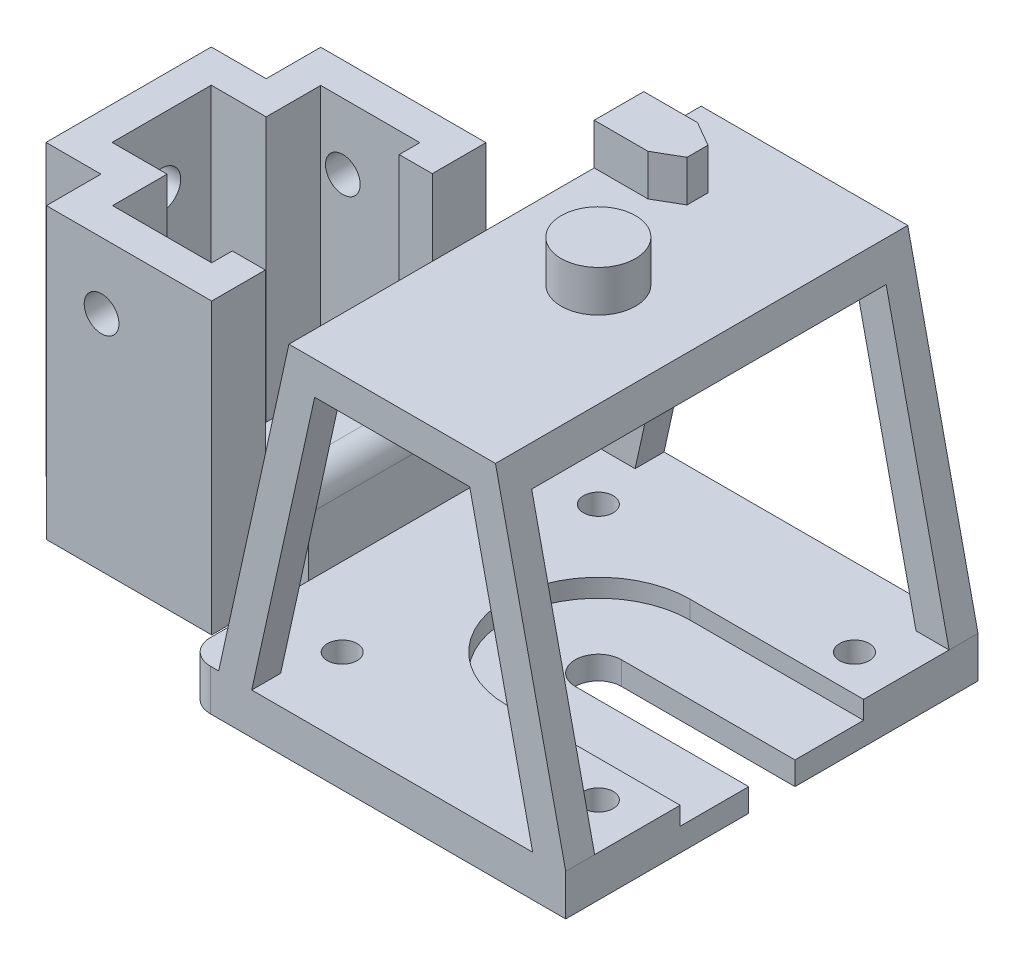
ISO-10303-21;
HEADER;
FILE_DESCRIPTION(('STEP AP214'),'2;1');
FILE_NAME('part.step','',(''),(''),'','','');
FILE_SCHEMA(('AUTOMOTIVE_DESIGN { 1 0 10303 214 1 1 1 1 }'));
ENDSEC;
DATA;
#1=APPLICATION_CONTEXT('core data for automotive mechanical design processes');
#2=APPLICATION_PROTOCOL_DEFINITION('international standard','automotive_design',2000,#1);
#3=PRODUCT_CONTEXT('',#1,'mechanical');
#4=PRODUCT('Part','Part','',(#3));
#5=PRODUCT_RELATED_PRODUCT_CATEGORY('part','',(#4));
#6=PRODUCT_DEFINITION_FORMATION('','',#4);
#7=PRODUCT_DEFINITION_CONTEXT('part definition',#1,'design');
#8=PRODUCT_DEFINITION('design','',#6,#7);
#9=PRODUCT_DEFINITION_SHAPE('','',#8);
#10=(LENGTH_UNIT() NAMED_UNIT(*) SI_UNIT(.MILLI.,.METRE.));
#11=(NAMED_UNIT(*) PLANE_ANGLE_UNIT() SI_UNIT($,.RADIAN.));
#12=(NAMED_UNIT(*) SI_UNIT($,.STERADIAN.) SOLID_ANGLE_UNIT());
#13=UNCERTAINTY_MEASURE_WITH_UNIT(LENGTH_MEASURE(1.E-05),#10,'distance_accuracy_value','');
#14=(GEOMETRIC_REPRESENTATION_CONTEXT(3) GLOBAL_UNCERTAINTY_ASSIGNED_CONTEXT((#13)) GLOBAL_UNIT_ASSIGNED_CONTEXT((#10,
#11,#12)) REPRESENTATION_CONTEXT('',''));
#15=CARTESIAN_POINT('',(0.,0.,0.));
#16=DIRECTION('',(0.,0.,1.));
#17=DIRECTION('',(1.,0.,0.));
#18=AXIS2_PLACEMENT_3D('',#15,#16,#17);
#19=CARTESIAN_POINT('',(0.,5.,0.));
#20=DIRECTION('',(0.,-1.,0.));
#21=DIRECTION('',(0.,0.,-1.));
#22=AXIS2_PLACEMENT_3D('',#19,#20,#21);
#23=PLANE('',#22);
#24=CARTESIAN_POINT('',(41.35,5.,15.5));
#25=DIRECTION('',(0.,1.,0.));
#26=DIRECTION('',(0.,0.,1.));
#27=AXIS2_PLACEMENT_3D('',#24,#25,#26);
#28=CIRCLE('',#27,1.8);
#29=CARTESIAN_POINT('',(41.35,5.,17.3));
#30=VERTEX_POINT('',#29);
#31=EDGE_CURVE('E668',#30,#30,#28,.T.);
#32=ORIENTED_EDGE('',*,*,#31,.F.);
#33=EDGE_LOOP('',(#32));
#34=FACE_BOUND('',#33,.T.);
#35=CARTESIAN_POINT('',(72.35,5.,15.5));
#36=DIRECTION('',(0.,1.,0.));
#37=DIRECTION('',(0.,0.,1.));
#38=AXIS2_PLACEMENT_3D('',#35,#36,#37);
#39=CIRCLE('',#38,1.79999999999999);
#40=CARTESIAN_POINT('',(72.35,5.,17.3));
#41=VERTEX_POINT('',#40);
#42=EDGE_CURVE('E678',#41,#41,#39,.T.);
#43=ORIENTED_EDGE('',*,*,#42,.F.);
#44=EDGE_LOOP('',(#43));
#45=FACE_BOUND('',#44,.T.);
#46=CARTESIAN_POINT('',(72.35,5.,-15.5));
#47=DIRECTION('',(0.,1.,0.));
#48=DIRECTION('',(0.,0.,1.));
#49=AXIS2_PLACEMENT_3D('',#46,#47,#48);
#50=CIRCLE('',#49,1.79999999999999);
#51=CARTESIAN_POINT('',(72.35,5.,-13.7));
#52=VERTEX_POINT('',#51);
#53=EDGE_CURVE('E674',#52,#52,#50,.T.);
#54=ORIENTED_EDGE('',*,*,#53,.F.);
#55=EDGE_LOOP('',(#54));
#56=FACE_BOUND('',#55,.T.);
#57=CARTESIAN_POINT('',(41.35,5.,-15.5));
#58=DIRECTION('',(0.,1.,0.));
#59=DIRECTION('',(0.,0.,1.));
#60=AXIS2_PLACEMENT_3D('',#57,#58,#59);
#61=CIRCLE('',#60,1.8);
#62=CARTESIAN_POINT('',(41.35,5.,-13.7));
#63=VERTEX_POINT('',#62);
#64=EDGE_CURVE('E669',#63,#63,#61,.T.);
#65=ORIENTED_EDGE('',*,*,#64,.F.);
#66=EDGE_LOOP('',(#65));
#67=FACE_BOUND('',#66,.T.);
#68=DIRECTION('',(0.,0.,-1.));
#69=VECTOR('',#68,1.);
#70=CARTESIAN_POINT('',(31.85,5.,-10.1));
#71=LINE('',#70,#69);
#72=CARTESIAN_POINT('',(31.85,5.,10.1));
#73=VERTEX_POINT('',#72);
#74=CARTESIAN_POINT('',(31.85,5.,-10.1));
#75=VERTEX_POINT('',#74);
#76=EDGE_CURVE('E435',#73,#75,#71,.T.);
#77=ORIENTED_EDGE('',*,*,#76,.F.);
#78=DIRECTION('',(0.,0.,1.));
#79=VECTOR('',#78,1.);
#80=CARTESIAN_POINT('',(31.85,5.,10.1));
#81=LINE('',#80,#79);
#82=CARTESIAN_POINT('',(31.85,5.,21.95));
#83=VERTEX_POINT('',#82);
#84=EDGE_CURVE('E720',#73,#83,#81,.T.);
#85=ORIENTED_EDGE('',*,*,#84,.T.);
#86=CARTESIAN_POINT('',(34.85,5.,21.95));
#87=DIRECTION('',(0.,-1.,0.));
#88=DIRECTION('',(0.,0.,-1.));
#89=AXIS2_PLACEMENT_3D('',#86,#87,#88);
#90=CIRCLE('',#89,3.);
#91=CARTESIAN_POINT('',(34.85,5.,24.95));
#92=VERTEX_POINT('',#91);
#93=EDGE_CURVE('E907',#83,#92,#90,.F.);
#94=ORIENTED_EDGE('',*,*,#93,.T.);
#95=DIRECTION('',(-1.,0.,0.));
#96=VECTOR('',#95,1.);
#97=CARTESIAN_POINT('',(77.85,5.,24.95));
#98=LINE('',#97,#96);
#99=CARTESIAN_POINT('',(35.85,5.,24.95));
#100=VERTEX_POINT('',#99);
#101=EDGE_CURVE('E714',#100,#92,#98,.T.);
#102=ORIENTED_EDGE('',*,*,#101,.F.);
#103=DIRECTION('',(0.,0.,1.));
#104=VECTOR('',#103,1.);
#105=CARTESIAN_POINT('',(35.85,5.,21.45));
#106=LINE('',#105,#104);
#107=CARTESIAN_POINT('',(35.85,5.,21.45));
#108=VERTEX_POINT('',#107);
#109=EDGE_CURVE('E611',#108,#100,#106,.T.);
#110=ORIENTED_EDGE('',*,*,#109,.F.);
#111=DIRECTION('',(1.,0.,0.));
#112=VECTOR('',#111,1.);
#113=CARTESIAN_POINT('',(39.85,5.,21.45));
#114=LINE('',#113,#112);
#115=CARTESIAN_POINT('',(39.85,5.,21.45));
#116=VERTEX_POINT('',#115);
#117=EDGE_CURVE('E563',#108,#116,#114,.T.);
#118=ORIENTED_EDGE('',*,*,#117,.T.);
#119=DIRECTION('',(0.,0.,1.));
#120=VECTOR('',#119,1.);
#121=CARTESIAN_POINT('',(39.85,5.,21.45));
#122=LINE('',#121,#120);
#123=CARTESIAN_POINT('',(39.85,5.,24.95));
#124=VERTEX_POINT('',#123);
#125=EDGE_CURVE('E607',#116,#124,#122,.T.);
#126=ORIENTED_EDGE('',*,*,#125,.T.);
#127=CARTESIAN_POINT('',(73.85,5.,24.95));
#128=VERTEX_POINT('',#127);
#129=EDGE_CURVE('E719',#128,#124,#98,.T.);
#130=ORIENTED_EDGE('',*,*,#129,.F.);
#131=DIRECTION('',(0.,0.,1.));
#132=VECTOR('',#131,1.);
#133=CARTESIAN_POINT('',(73.85,5.,21.45));
#134=LINE('',#133,#132);
#135=CARTESIAN_POINT('',(73.85,5.,21.45));
#136=VERTEX_POINT('',#135);
#137=EDGE_CURVE('E596',#136,#128,#134,.T.);
#138=ORIENTED_EDGE('',*,*,#137,.F.);
#139=DIRECTION('',(1.,0.,0.));
#140=VECTOR('',#139,1.);
#141=CARTESIAN_POINT('',(77.85,5.,21.45));
#142=LINE('',#141,#140);
#143=CARTESIAN_POINT('',(77.85,5.,21.45));
#144=VERTEX_POINT('',#143);
#145=EDGE_CURVE('E551',#136,#144,#142,.T.);
#146=ORIENTED_EDGE('',*,*,#145,.T.);
#147=DIRECTION('',(0.,0.,-1.));
#148=VECTOR('',#147,1.);
#149=CARTESIAN_POINT('',(77.85,5.,24.95));
#150=LINE('',#149,#148);
#151=CARTESIAN_POINT('',(77.85,5.,11.1));
#152=VERTEX_POINT('',#151);
#153=EDGE_CURVE('E715',#144,#152,#150,.T.);
#154=ORIENTED_EDGE('',*,*,#153,.T.);
#155=DIRECTION('',(1.,0.,0.));
#156=VECTOR('',#155,1.);
#157=CARTESIAN_POINT('',(77.85,5.,11.1));
#158=LINE('',#157,#156);
#159=CARTESIAN_POINT('',(56.85,5.,11.1));
#160=VERTEX_POINT('',#159);
#161=EDGE_CURVE('E643',#160,#152,#158,.T.);
#162=ORIENTED_EDGE('',*,*,#161,.F.);
#163=CARTESIAN_POINT('',(56.85,5.,0.));
#164=DIRECTION('',(0.,1.,0.));
#165=DIRECTION('',(0.,0.,1.));
#166=AXIS2_PLACEMENT_3D('',#163,#164,#165);
#167=CIRCLE('',#166,11.1);
#168=CARTESIAN_POINT('',(56.85,5.,-11.1));
#169=VERTEX_POINT('',#168);
#170=EDGE_CURVE('E600',#169,#160,#167,.T.);
#171=ORIENTED_EDGE('',*,*,#170,.F.);
#172=DIRECTION('',(-1.,0.,0.));
#173=VECTOR('',#172,1.);
#174=CARTESIAN_POINT('',(56.85,5.,-11.1));
#175=LINE('',#174,#173);
#176=CARTESIAN_POINT('',(77.85,5.,-11.1));
#177=VERTEX_POINT('',#176);
#178=EDGE_CURVE('E627',#177,#169,#175,.T.);
#179=ORIENTED_EDGE('',*,*,#178,.F.);
#180=CARTESIAN_POINT('',(77.85,5.,-21.45));
#181=VERTEX_POINT('',#180);
#182=EDGE_CURVE('E710',#177,#181,#150,.T.);
#183=ORIENTED_EDGE('',*,*,#182,.T.);
#184=DIRECTION('',(1.,0.,0.));
#185=VECTOR('',#184,1.);
#186=CARTESIAN_POINT('',(77.85,5.,-21.45));
#187=LINE('',#186,#185);
#188=CARTESIAN_POINT('',(73.85,5.,-21.45));
#189=VERTEX_POINT('',#188);
#190=EDGE_CURVE('E486',#189,#181,#187,.T.);
#191=ORIENTED_EDGE('',*,*,#190,.F.);
#192=DIRECTION('',(0.,0.,-1.));
#193=VECTOR('',#192,1.);
#194=CARTESIAN_POINT('',(73.85,5.,-21.45));
#195=LINE('',#194,#193);
#196=CARTESIAN_POINT('',(73.85,5.,-24.95));
#197=VERTEX_POINT('',#196);
#198=EDGE_CURVE('E508',#189,#197,#195,.T.);
#199=ORIENTED_EDGE('',*,*,#198,.T.);
#200=DIRECTION('',(1.,0.,0.));
#201=VECTOR('',#200,1.);
#202=CARTESIAN_POINT('',(31.85,5.,-24.95));
#203=LINE('',#202,#201);
#204=CARTESIAN_POINT('',(39.85,5.,-24.95));
#205=VERTEX_POINT('',#204);
#206=EDGE_CURVE('E705',#205,#197,#203,.T.);
#207=ORIENTED_EDGE('',*,*,#206,.F.);
#208=DIRECTION('',(0.,0.,-1.));
#209=VECTOR('',#208,1.);
#210=CARTESIAN_POINT('',(39.85,5.,-21.45));
#211=LINE('',#210,#209);
#212=CARTESIAN_POINT('',(39.85,5.,-21.45));
#213=VERTEX_POINT('',#212);
#214=EDGE_CURVE('E536',#213,#205,#211,.T.);
#215=ORIENTED_EDGE('',*,*,#214,.F.);
#216=DIRECTION('',(1.,0.,0.));
#217=VECTOR('',#216,1.);
#218=CARTESIAN_POINT('',(39.85,5.,-21.45));
#219=LINE('',#218,#217);
#220=CARTESIAN_POINT('',(35.85,5.,-21.45));
#221=VERTEX_POINT('',#220);
#222=EDGE_CURVE('E498',#221,#213,#219,.T.);
#223=ORIENTED_EDGE('',*,*,#222,.F.);
#224=DIRECTION('',(0.,0.,-1.));
#225=VECTOR('',#224,1.);
#226=CARTESIAN_POINT('',(35.85,5.,-21.45));
#227=LINE('',#226,#225);
#228=CARTESIAN_POINT('',(35.85,5.,-24.95));
#229=VERTEX_POINT('',#228);
#230=EDGE_CURVE('E532',#221,#229,#227,.T.);
#231=ORIENTED_EDGE('',*,*,#230,.T.);
#232=CARTESIAN_POINT('',(34.85,5.,-24.95));
#233=VERTEX_POINT('',#232);
#234=EDGE_CURVE('E707',#233,#229,#203,.T.);
#235=ORIENTED_EDGE('',*,*,#234,.F.);
#236=CARTESIAN_POINT('',(34.85,5.,-21.95));
#237=DIRECTION('',(0.,-1.,0.));
#238=DIRECTION('',(0.,0.,-1.));
#239=AXIS2_PLACEMENT_3D('',#236,#237,#238);
#240=CIRCLE('',#239,3.);
#241=CARTESIAN_POINT('',(31.85,5.,-21.95));
#242=VERTEX_POINT('',#241);
#243=EDGE_CURVE('E904',#233,#242,#240,.F.);
#244=ORIENTED_EDGE('',*,*,#243,.T.);
#245=DIRECTION('',(0.,0.,-1.));
#246=VECTOR('',#245,1.);
#247=CARTESIAN_POINT('',(31.85,5.,-10.1));
#248=LINE('',#247,#246);
#249=EDGE_CURVE('E701',#75,#242,#248,.T.);
#250=ORIENTED_EDGE('',*,*,#249,.F.);
#251=EDGE_LOOP('',(#77,#85,#94,#102,#110,#118,#126,#130,#138,#146,#154,#162,#171,#179,#183,#191,
#199,#207,#215,#223,#231,#235,#244,#250));
#252=FACE_BOUND('',#251,.T.);
#253=ADVANCED_FACE('F45',(#34,#45,#56,#67,#252),#23,.F.);
#254=CARTESIAN_POINT('',(44.35,43.5,21.45));
#255=DIRECTION('',(0.,1.,0.));
#256=DIRECTION('',(0.,0.,1.));
#257=AXIS2_PLACEMENT_3D('',#254,#255,#256);
#258=PLANE('',#257);
#259=CARTESIAN_POINT('',(56.85,43.5,0.));
#260=DIRECTION('',(0.,1.,0.));
#261=DIRECTION('',(0.,0.,1.));
#262=AXIS2_PLACEMENT_3D('',#259,#260,#261);
#263=CIRCLE('',#262,4.5);
#264=CARTESIAN_POINT('',(56.85,43.5,4.5));
#265=VERTEX_POINT('',#264);
#266=EDGE_CURVE('E466',#265,#265,#263,.T.);
#267=ORIENTED_EDGE('',*,*,#266,.F.);
#268=EDGE_LOOP('',(#267));
#269=FACE_BOUND('',#268,.T.);
#270=DIRECTION('',(0.866025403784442,0.,-0.499999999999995));
#271=VECTOR('',#270,1.);
#272=CARTESIAN_POINT('',(53.85,43.5,-13.7320508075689));
#273=LINE('',#272,#271);
#274=CARTESIAN_POINT('',(50.85,43.5,-12.));
#275=VERTEX_POINT('',#274);
#276=CARTESIAN_POINT('',(53.85,43.5,-13.7320508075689));
#277=VERTEX_POINT('',#276);
#278=EDGE_CURVE('E978',#275,#277,#273,.T.);
#279=ORIENTED_EDGE('',*,*,#278,.F.);
#280=DIRECTION('',(1.,0.,0.));
#281=VECTOR('',#280,1.);
#282=CARTESIAN_POINT('',(44.35,43.5,-12.));
#283=LINE('',#282,#281);
#284=CARTESIAN_POINT('',(44.35,43.5,-12.));
#285=VERTEX_POINT('',#284);
#286=EDGE_CURVE('E976',#285,#275,#283,.T.);
#287=ORIENTED_EDGE('',*,*,#286,.F.);
#288=DIRECTION('',(0.,0.,1.));
#289=VECTOR('',#288,1.);
#290=CARTESIAN_POINT('',(44.35,43.5,21.45));
#291=LINE('',#290,#289);
#292=CARTESIAN_POINT('',(44.35,43.5,24.95));
#293=VERTEX_POINT('',#292);
#294=EDGE_CURVE('E619',#285,#293,#291,.T.);
#295=ORIENTED_EDGE('',*,*,#294,.T.);
#296=DIRECTION('',(-1.,0.,0.));
#297=VECTOR('',#296,1.);
#298=CARTESIAN_POINT('',(44.35,43.5,24.95));
#299=LINE('',#298,#297);
#300=CARTESIAN_POINT('',(69.35,43.5,24.95));
#301=VERTEX_POINT('',#300);
#302=EDGE_CURVE('E579',#301,#293,#299,.T.);
#303=ORIENTED_EDGE('',*,*,#302,.F.);
#304=DIRECTION('',(0.,0.,1.));
#305=VECTOR('',#304,1.);
#306=CARTESIAN_POINT('',(69.35,43.5,21.45));
#307=LINE('',#306,#305);
#308=CARTESIAN_POINT('',(69.35,43.5,-24.95));
#309=VERTEX_POINT('',#308);
#310=EDGE_CURVE('E575',#309,#301,#307,.T.);
#311=ORIENTED_EDGE('',*,*,#310,.F.);
#312=DIRECTION('',(-1.,0.,0.));
#313=VECTOR('',#312,1.);
#314=CARTESIAN_POINT('',(44.35,43.5,-24.95));
#315=LINE('',#314,#313);
#316=CARTESIAN_POINT('',(44.35,43.5,-24.95));
#317=VERTEX_POINT('',#316);
#318=EDGE_CURVE('E521',#309,#317,#315,.T.);
#319=ORIENTED_EDGE('',*,*,#318,.T.);
#320=CARTESIAN_POINT('',(44.35,43.5,-18.));
#321=VERTEX_POINT('',#320);
#322=EDGE_CURVE('E615',#317,#321,#291,.T.);
#323=ORIENTED_EDGE('',*,*,#322,.T.);
#324=DIRECTION('',(-1.,0.,0.));
#325=VECTOR('',#324,1.);
#326=CARTESIAN_POINT('',(44.35,43.5,-18.));
#327=LINE('',#326,#325);
#328=CARTESIAN_POINT('',(50.85,43.5,-18.));
#329=VERTEX_POINT('',#328);
#330=EDGE_CURVE('E1000',#329,#321,#327,.T.);
#331=ORIENTED_EDGE('',*,*,#330,.F.);
#332=DIRECTION('',(-0.866025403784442,0.,-0.499999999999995));
#333=VECTOR('',#332,1.);
#334=CARTESIAN_POINT('',(53.85,43.5,-16.2679491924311));
#335=LINE('',#334,#333);
#336=CARTESIAN_POINT('',(53.85,43.5,-16.2679491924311));
#337=VERTEX_POINT('',#336);
#338=EDGE_CURVE('E996',#337,#329,#335,.T.);
#339=ORIENTED_EDGE('',*,*,#338,.F.);
#340=DIRECTION('',(0.,0.,-1.));
#341=VECTOR('',#340,1.);
#342=CARTESIAN_POINT('',(53.85,43.5,-16.2679491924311));
#343=LINE('',#342,#341);
#344=EDGE_CURVE('E987',#277,#337,#343,.T.);
#345=ORIENTED_EDGE('',*,*,#344,.F.);
#346=EDGE_LOOP('',(#279,#287,#295,#303,#311,#319,#323,#331,#339,#345));
#347=FACE_BOUND('',#346,.T.);
#348=ADVANCED_FACE('F974',(#269,#347),#258,.T.);
#349=CARTESIAN_POINT('',(0.,0.,21.45));
#350=DIRECTION('',(0.,0.,-1.));
#351=DIRECTION('',(-1.,0.,0.));
#352=AXIS2_PLACEMENT_3D('',#349,#350,#351);
#353=PLANE('',#352);
#354=DIRECTION('',(-0.215587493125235,-0.976484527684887,0.));
#355=VECTOR('',#354,1.);
#356=CARTESIAN_POINT('',(35.85,5.,21.45));
#357=LINE('',#356,#355);
#358=CARTESIAN_POINT('',(43.4668831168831,39.5,21.45));
#359=VERTEX_POINT('',#358);
#360=EDGE_CURVE('E560',#359,#108,#357,.T.);
#361=ORIENTED_EDGE('',*,*,#360,.F.);
#362=DIRECTION('',(-1.,0.,0.));
#363=VECTOR('',#362,1.);
#364=CARTESIAN_POINT('',(43.4668831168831,39.5,21.45));
#365=LINE('',#364,#363);
#366=CARTESIAN_POINT('',(47.4668831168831,39.5,21.45));
#367=VERTEX_POINT('',#366);
#368=EDGE_CURVE('E479',#367,#359,#365,.T.);
#369=ORIENTED_EDGE('',*,*,#368,.F.);
#370=DIRECTION('',(0.215587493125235,0.976484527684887,0.));
#371=VECTOR('',#370,1.);
#372=CARTESIAN_POINT('',(47.4668831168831,39.5,21.45));
#373=LINE('',#372,#371);
#374=EDGE_CURVE('E567',#116,#367,#373,.T.);
#375=ORIENTED_EDGE('',*,*,#374,.F.);
#376=ORIENTED_EDGE('',*,*,#117,.F.);
#377=EDGE_LOOP('',(#361,#369,#375,#376));
#378=FACE_BOUND('',#377,.T.);
#379=ADVANCED_FACE('F961',(#378),#353,.T.);
#380=DIRECTION('',(0.215587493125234,-0.976484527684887,0.));
#381=VECTOR('',#380,1.);
#382=CARTESIAN_POINT('',(73.85,5.,21.45));
#383=LINE('',#382,#381);
#384=CARTESIAN_POINT('',(66.2331168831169,39.5,21.45));
#385=VERTEX_POINT('',#384);
#386=EDGE_CURVE('E571',#385,#136,#383,.T.);
#387=ORIENTED_EDGE('',*,*,#386,.F.);
#388=CARTESIAN_POINT('',(70.2331168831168,39.5,21.45));
#389=VERTEX_POINT('',#388);
#390=EDGE_CURVE('E475',#389,#385,#365,.T.);
#391=ORIENTED_EDGE('',*,*,#390,.F.);
#392=DIRECTION('',(-0.215587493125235,0.976484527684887,0.));
#393=VECTOR('',#392,1.);
#394=CARTESIAN_POINT('',(69.35,43.5,21.45));
#395=LINE('',#394,#393);
#396=EDGE_CURVE('E555',#144,#389,#395,.T.);
#397=ORIENTED_EDGE('',*,*,#396,.F.);
#398=ORIENTED_EDGE('',*,*,#145,.F.);
#399=EDGE_LOOP('',(#387,#391,#397,#398));
#400=FACE_BOUND('',#399,.T.);
#401=ADVANCED_FACE('F1695',(#400),#353,.T.);
#402=CARTESIAN_POINT('',(0.,0.,-21.45));
#403=DIRECTION('',(0.,0.,1.));
#404=DIRECTION('',(-1.,0.,0.));
#405=AXIS2_PLACEMENT_3D('',#402,#403,#404);
#406=PLANE('',#405);
#407=DIRECTION('',(-0.215587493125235,0.976484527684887,0.));
#408=VECTOR('',#407,1.);
#409=CARTESIAN_POINT('',(69.35,43.5,-21.45));
#410=LINE('',#409,#408);
#411=CARTESIAN_POINT('',(70.2331168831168,39.5,-21.45));
#412=VERTEX_POINT('',#411);
#413=EDGE_CURVE('E504',#181,#412,#410,.T.);
#414=ORIENTED_EDGE('',*,*,#413,.T.);
#415=DIRECTION('',(-1.,0.,0.));
#416=VECTOR('',#415,1.);
#417=CARTESIAN_POINT('',(0.,39.5,-21.45));
#418=LINE('',#417,#416);
#419=CARTESIAN_POINT('',(66.2331168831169,39.5,-21.45));
#420=VERTEX_POINT('',#419);
#421=EDGE_CURVE('E471',#412,#420,#418,.T.);
#422=ORIENTED_EDGE('',*,*,#421,.T.);
#423=DIRECTION('',(0.215587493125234,-0.976484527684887,0.));
#424=VECTOR('',#423,1.);
#425=CARTESIAN_POINT('',(73.85,5.,-21.45));
#426=LINE('',#425,#424);
#427=EDGE_CURVE('E490',#420,#189,#426,.T.);
#428=ORIENTED_EDGE('',*,*,#427,.T.);
#429=ORIENTED_EDGE('',*,*,#190,.T.);
#430=EDGE_LOOP('',(#414,#422,#428,#429));
#431=FACE_BOUND('',#430,.T.);
#432=ADVANCED_FACE('F1361',(#431),#406,.T.);
#433=DIRECTION('',(0.215587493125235,0.976484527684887,0.));
#434=VECTOR('',#433,1.);
#435=CARTESIAN_POINT('',(47.4668831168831,39.5,-21.45));
#436=LINE('',#435,#434);
#437=CARTESIAN_POINT('',(47.4668831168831,39.5,-21.45));
#438=VERTEX_POINT('',#437);
#439=EDGE_CURVE('E494',#213,#438,#436,.T.);
#440=ORIENTED_EDGE('',*,*,#439,.T.);
#441=DIRECTION('',(1.,0.,0.));
#442=VECTOR('',#441,1.);
#443=CARTESIAN_POINT('',(66.2331168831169,39.5,-21.45));
#444=LINE('',#443,#442);
#445=CARTESIAN_POINT('',(43.4668831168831,39.5,-21.45));
#446=VERTEX_POINT('',#445);
#447=EDGE_CURVE('E465',#446,#438,#444,.T.);
#448=ORIENTED_EDGE('',*,*,#447,.F.);
#449=DIRECTION('',(-0.215587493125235,-0.976484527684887,0.));
#450=VECTOR('',#449,1.);
#451=CARTESIAN_POINT('',(35.85,5.,-21.45));
#452=LINE('',#451,#450);
#453=EDGE_CURVE('E501',#446,#221,#452,.T.);
#454=ORIENTED_EDGE('',*,*,#453,.T.);
#455=ORIENTED_EDGE('',*,*,#222,.T.);
#456=EDGE_LOOP('',(#440,#448,#454,#455));
#457=FACE_BOUND('',#456,.T.);
#458=ADVANCED_FACE('F1344',(#457),#406,.T.);
#459=CARTESIAN_POINT('',(56.85,-10.,0.));
#460=DIRECTION('',(0.,1.,0.));
#461=DIRECTION('',(0.,0.,1.));
#462=AXIS2_PLACEMENT_3D('',#459,#460,#461);
#463=CYLINDRICAL_SURFACE('',#462,2.8);
#464=CARTESIAN_POINT('',(56.85,2.8,0.));
#465=DIRECTION('',(0.,1.,0.));
#466=DIRECTION('',(0.,0.,1.));
#467=AXIS2_PLACEMENT_3D('',#464,#465,#466);
#468=CIRCLE('',#467,2.8);
#469=CARTESIAN_POINT('',(56.85,2.8,2.8));
#470=VERTEX_POINT('',#469);
#471=CARTESIAN_POINT('',(56.85,2.8,-2.8));
#472=VERTEX_POINT('',#471);
#473=EDGE_CURVE('E653',#470,#472,#468,.F.);
#474=ORIENTED_EDGE('',*,*,#473,.F.);
#475=DIRECTION('',(0.,1.,0.));
#476=VECTOR('',#475,1.);
#477=CARTESIAN_POINT('',(56.85,-10.,2.8));
#478=LINE('',#477,#476);
#479=CARTESIAN_POINT('',(56.85,0.,2.8));
#480=VERTEX_POINT('',#479);
#481=EDGE_CURVE('E673',#480,#470,#478,.T.);
#482=ORIENTED_EDGE('',*,*,#481,.F.);
#483=CARTESIAN_POINT('',(56.85,0.,0.));
#484=DIRECTION('',(0.,-1.,0.));
#485=DIRECTION('',(0.,0.,-1.));
#486=AXIS2_PLACEMENT_3D('',#483,#484,#485);
#487=CIRCLE('',#486,2.8);
#488=CARTESIAN_POINT('',(56.85,0.,-2.8));
#489=VERTEX_POINT('',#488);
#490=EDGE_CURVE('E835',#480,#489,#487,.T.);
#491=ORIENTED_EDGE('',*,*,#490,.T.);
#492=DIRECTION('',(0.,1.,0.));
#493=VECTOR('',#492,1.);
#494=CARTESIAN_POINT('',(56.85,-10.,-2.8));
#495=LINE('',#494,#493);
#496=EDGE_CURVE('E685',#489,#472,#495,.T.);
#497=ORIENTED_EDGE('',*,*,#496,.T.);
#498=EDGE_LOOP('',(#474,#482,#491,#497));
#499=FACE_BOUND('',#498,.T.);
#500=ADVANCED_FACE('F1184',(#499),#463,.F.);
#501=CARTESIAN_POINT('',(56.85,-10.,-2.8));
#502=DIRECTION('',(0.,0.,-1.));
#503=DIRECTION('',(-1.,0.,0.));
#504=AXIS2_PLACEMENT_3D('',#501,#502,#503);
#505=PLANE('',#504);
#506=DIRECTION('',(1.,0.,0.));
#507=VECTOR('',#506,1.);
#508=CARTESIAN_POINT('',(56.85,2.8,-2.8));
#509=LINE('',#508,#507);
#510=CARTESIAN_POINT('',(77.85,2.8,-2.8));
#511=VERTEX_POINT('',#510);
#512=EDGE_CURVE('E665',#472,#511,#509,.T.);
#513=ORIENTED_EDGE('',*,*,#512,.F.);
#514=ORIENTED_EDGE('',*,*,#496,.F.);
#515=DIRECTION('',(1.,0.,0.));
#516=VECTOR('',#515,1.);
#517=CARTESIAN_POINT('',(0.,0.,-2.80000000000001));
#518=LINE('',#517,#516);
#519=CARTESIAN_POINT('',(77.85,0.,-2.8));
#520=VERTEX_POINT('',#519);
#521=EDGE_CURVE('E838',#489,#520,#518,.T.);
#522=ORIENTED_EDGE('',*,*,#521,.T.);
#523=DIRECTION('',(0.,1.,0.));
#524=VECTOR('',#523,1.);
#525=CARTESIAN_POINT('',(77.85,-10.,-2.8));
#526=LINE('',#525,#524);
#527=EDGE_CURVE('E690',#520,#511,#526,.T.);
#528=ORIENTED_EDGE('',*,*,#527,.T.);
#529=EDGE_LOOP('',(#513,#514,#522,#528));
#530=FACE_BOUND('',#529,.T.);
#531=ADVANCED_FACE('F1744',(#530),#505,.F.);
#532=CARTESIAN_POINT('',(77.85,-10.,2.8));
#533=DIRECTION('',(0.,0.,1.));
#534=DIRECTION('',(1.,0.,0.));
#535=AXIS2_PLACEMENT_3D('',#532,#533,#534);
#536=PLANE('',#535);
#537=DIRECTION('',(-1.,0.,0.));
#538=VECTOR('',#537,1.);
#539=CARTESIAN_POINT('',(77.85,2.8,2.8));
#540=LINE('',#539,#538);
#541=CARTESIAN_POINT('',(77.85,2.8,2.8));
#542=VERTEX_POINT('',#541);
#543=EDGE_CURVE('E841',#542,#470,#540,.T.);
#544=ORIENTED_EDGE('',*,*,#543,.F.);
#545=DIRECTION('',(0.,1.,0.));
#546=VECTOR('',#545,1.);
#547=CARTESIAN_POINT('',(77.85,-10.,2.8));
#548=LINE('',#547,#546);
#549=CARTESIAN_POINT('',(77.85,0.,2.8));
#550=VERTEX_POINT('',#549);
#551=EDGE_CURVE('E694',#550,#542,#548,.T.);
#552=ORIENTED_EDGE('',*,*,#551,.F.);
#553=DIRECTION('',(-1.,0.,0.));
#554=VECTOR('',#553,1.);
#555=CARTESIAN_POINT('',(0.,0.,2.80000000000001));
#556=LINE('',#555,#554);
#557=EDGE_CURVE('E787',#550,#480,#556,.T.);
#558=ORIENTED_EDGE('',*,*,#557,.T.);
#559=ORIENTED_EDGE('',*,*,#481,.T.);
#560=EDGE_LOOP('',(#544,#552,#558,#559));
#561=FACE_BOUND('',#560,.T.);
#562=ADVANCED_FACE('F1746',(#561),#536,.F.);
#563=CARTESIAN_POINT('',(77.85,5.,24.95));
#564=DIRECTION('',(-1.,0.,0.));
#565=DIRECTION('',(0.,0.,1.));
#566=AXIS2_PLACEMENT_3D('',#563,#564,#565);
#567=PLANE('',#566);
#568=ORIENTED_EDGE('',*,*,#182,.F.);
#569=DIRECTION('',(0.,1.,0.));
#570=VECTOR('',#569,1.);
#571=CARTESIAN_POINT('',(77.85,2.8,-11.1));
#572=LINE('',#571,#570);
#573=CARTESIAN_POINT('',(77.85,2.8,-11.1));
#574=VERTEX_POINT('',#573);
#575=EDGE_CURVE('E654',#574,#177,#572,.T.);
#576=ORIENTED_EDGE('',*,*,#575,.F.);
#577=DIRECTION('',(0.,0.,-1.));
#578=VECTOR('',#577,1.);
#579=CARTESIAN_POINT('',(77.85,2.8,-11.1));
#580=LINE('',#579,#578);
#581=EDGE_CURVE('E631',#511,#574,#580,.T.);
#582=ORIENTED_EDGE('',*,*,#581,.F.);
#583=ORIENTED_EDGE('',*,*,#527,.F.);
#584=DIRECTION('',(0.,0.,-1.));
#585=VECTOR('',#584,1.);
#586=CARTESIAN_POINT('',(77.85,0.,24.95));
#587=LINE('',#586,#585);
#588=CARTESIAN_POINT('',(77.85,0.,-24.95));
#589=VERTEX_POINT('',#588);
#590=EDGE_CURVE('E750',#520,#589,#587,.T.);
#591=ORIENTED_EDGE('',*,*,#590,.T.);
#592=DIRECTION('',(0.,-1.,0.));
#593=VECTOR('',#592,1.);
#594=CARTESIAN_POINT('',(77.85,5.,-24.95));
#595=LINE('',#594,#593);
#596=CARTESIAN_POINT('',(77.85,5.,-24.95));
#597=VERTEX_POINT('',#596);
#598=EDGE_CURVE('E818',#597,#589,#595,.T.);
#599=ORIENTED_EDGE('',*,*,#598,.F.);
#600=DIRECTION('',(0.,0.,-1.));
#601=VECTOR('',#600,1.);
#602=CARTESIAN_POINT('',(77.85,5.,-21.45));
#603=LINE('',#602,#601);
#604=EDGE_CURVE('E528',#181,#597,#603,.T.);
#605=ORIENTED_EDGE('',*,*,#604,.F.);
#606=EDGE_LOOP('',(#568,#576,#582,#583,#591,#599,#605));
#607=FACE_BOUND('',#606,.T.);
#608=ADVANCED_FACE('F1229',(#607),#567,.F.);
#609=CARTESIAN_POINT('',(6.65,5.,-10.));
#610=DIRECTION('',(-1.,0.,0.));
#611=DIRECTION('',(0.,0.,1.));
#612=AXIS2_PLACEMENT_3D('',#609,#610,#611);
#613=PLANE('',#612);
#614=DIRECTION('',(0.,0.,-1.));
#615=VECTOR('',#614,1.);
#616=CARTESIAN_POINT('',(6.65,0.,-10.));
#617=LINE('',#616,#615);
#618=CARTESIAN_POINT('',(6.65,0.,-10.));
#619=VERTEX_POINT('',#618);
#620=CARTESIAN_POINT('',(6.65,0.,-16.6));
#621=VERTEX_POINT('',#620);
#622=EDGE_CURVE('E725',#619,#621,#617,.T.);
#623=ORIENTED_EDGE('',*,*,#622,.F.);
#624=DIRECTION('',(0.,-1.,0.));
#625=VECTOR('',#624,1.);
#626=CARTESIAN_POINT('',(6.65,5.,-10.));
#627=LINE('',#626,#625);
#628=CARTESIAN_POINT('',(6.65,35.,-10.));
#629=VERTEX_POINT('',#628);
#630=EDGE_CURVE('E784',#629,#619,#627,.T.);
#631=ORIENTED_EDGE('',*,*,#630,.F.);
#632=DIRECTION('',(0.,0.,1.));
#633=VECTOR('',#632,1.);
#634=CARTESIAN_POINT('',(6.65,35.,-10.));
#635=LINE('',#634,#633);
#636=CARTESIAN_POINT('',(6.65,35.,-16.6));
#637=VERTEX_POINT('',#636);
#638=EDGE_CURVE('E1073',#637,#629,#635,.T.);
#639=ORIENTED_EDGE('',*,*,#638,.F.);
#640=DIRECTION('',(0.,-1.,0.));
#641=VECTOR('',#640,1.);
#642=CARTESIAN_POINT('',(6.65,5.,-16.6));
#643=LINE('',#642,#641);
#644=EDGE_CURVE('E724',#637,#621,#643,.T.);
#645=ORIENTED_EDGE('',*,*,#644,.T.);
#646=EDGE_LOOP('',(#623,#631,#639,#645));
#647=FACE_BOUND('',#646,.T.);
#648=ADVANCED_FACE('F1194',(#647),#613,.T.);
#649=CARTESIAN_POINT('',(0.,5.,-10.));
#650=DIRECTION('',(0.,0.,-1.));
#651=DIRECTION('',(-1.,0.,0.));
#652=AXIS2_PLACEMENT_3D('',#649,#650,#651);
#653=PLANE('',#652);
#654=DIRECTION('',(1.,0.,0.));
#655=VECTOR('',#654,1.);
#656=CARTESIAN_POINT('',(0.,0.,-10.));
#657=LINE('',#656,#655);
#658=CARTESIAN_POINT('',(0.,0.,-10.));
#659=VERTEX_POINT('',#658);
#660=EDGE_CURVE('E706',#659,#619,#657,.T.);
#661=ORIENTED_EDGE('',*,*,#660,.F.);
#662=DIRECTION('',(0.,-1.,0.));
#663=VECTOR('',#662,1.);
#664=CARTESIAN_POINT('',(0.,5.,-10.));
#665=LINE('',#664,#663);
#666=CARTESIAN_POINT('',(0.,35.,-10.));
#667=VERTEX_POINT('',#666);
#668=EDGE_CURVE('E788',#667,#659,#665,.T.);
#669=ORIENTED_EDGE('',*,*,#668,.F.);
#670=DIRECTION('',(-1.,0.,0.));
#671=VECTOR('',#670,1.);
#672=CARTESIAN_POINT('',(0.,35.,-10.));
#673=LINE('',#672,#671);
#674=EDGE_CURVE('E1077',#629,#667,#673,.T.);
#675=ORIENTED_EDGE('',*,*,#674,.F.);
#676=ORIENTED_EDGE('',*,*,#630,.T.);
#677=EDGE_LOOP('',(#661,#669,#675,#676));
#678=FACE_BOUND('',#677,.T.);
#679=ADVANCED_FACE('F1190',(#678),#653,.T.);
#680=CARTESIAN_POINT('',(0.,5.,10.));
#681=DIRECTION('',(-1.,0.,0.));
#682=DIRECTION('',(0.,0.,1.));
#683=AXIS2_PLACEMENT_3D('',#680,#681,#682);
#684=PLANE('',#683);
#685=CARTESIAN_POINT('',(0.,27.,0.));
#686=DIRECTION('',(-1.,0.,0.));
#687=DIRECTION('',(0.,0.,1.));
#688=AXIS2_PLACEMENT_3D('',#685,#686,#687);
#689=CIRCLE('',#688,2.3);
#690=CARTESIAN_POINT('',(0.,27.,2.3));
#691=VERTEX_POINT('',#690);
#692=EDGE_CURVE('E927',#691,#691,#689,.T.);
#693=ORIENTED_EDGE('',*,*,#692,.F.);
#694=EDGE_LOOP('',(#693));
#695=FACE_BOUND('',#694,.T.);
#696=DIRECTION('',(0.,0.,-1.));
#697=VECTOR('',#696,1.);
#698=CARTESIAN_POINT('',(0.,0.,10.));
#699=LINE('',#698,#697);
#700=CARTESIAN_POINT('',(0.,0.,10.));
#701=VERTEX_POINT('',#700);
#702=EDGE_CURVE('E777',#701,#659,#699,.T.);
#703=ORIENTED_EDGE('',*,*,#702,.F.);
#704=DIRECTION('',(0.,-1.,0.));
#705=VECTOR('',#704,1.);
#706=CARTESIAN_POINT('',(0.,5.,10.));
#707=LINE('',#706,#705);
#708=CARTESIAN_POINT('',(0.,35.,10.));
#709=VERTEX_POINT('',#708);
#710=EDGE_CURVE('E791',#709,#701,#707,.T.);
#711=ORIENTED_EDGE('',*,*,#710,.F.);
#712=DIRECTION('',(0.,0.,1.));
#713=VECTOR('',#712,1.);
#714=CARTESIAN_POINT('',(0.,35.,10.));
#715=LINE('',#714,#713);
#716=EDGE_CURVE('E1081',#667,#709,#715,.T.);
#717=ORIENTED_EDGE('',*,*,#716,.F.);
#718=ORIENTED_EDGE('',*,*,#668,.T.);
#719=EDGE_LOOP('',(#703,#711,#717,#718));
#720=FACE_BOUND('',#719,.T.);
#721=ADVANCED_FACE('F1193',(#695,#720),#684,.T.);
#722=CARTESIAN_POINT('',(0.,5.,10.));
#723=DIRECTION('',(0.,0.,-1.));
#724=DIRECTION('',(-1.,0.,0.));
#725=AXIS2_PLACEMENT_3D('',#722,#723,#724);
#726=PLANE('',#725);
#727=DIRECTION('',(1.,0.,0.));
#728=VECTOR('',#727,1.);
#729=CARTESIAN_POINT('',(0.,0.,10.));
#730=LINE('',#729,#728);
#731=CARTESIAN_POINT('',(6.65,0.,10.));
#732=VERTEX_POINT('',#731);
#733=EDGE_CURVE('E774',#701,#732,#730,.T.);
#734=ORIENTED_EDGE('',*,*,#733,.T.);
#735=DIRECTION('',(0.,-1.,0.));
#736=VECTOR('',#735,1.);
#737=CARTESIAN_POINT('',(6.65,5.,10.));
#738=LINE('',#737,#736);
#739=CARTESIAN_POINT('',(6.65,35.,10.));
#740=VERTEX_POINT('',#739);
#741=EDGE_CURVE('E794',#740,#732,#738,.T.);
#742=ORIENTED_EDGE('',*,*,#741,.F.);
#743=DIRECTION('',(1.,0.,0.));
#744=VECTOR('',#743,1.);
#745=CARTESIAN_POINT('',(0.,35.,10.));
#746=LINE('',#745,#744);
#747=EDGE_CURVE('E1085',#709,#740,#746,.T.);
#748=ORIENTED_EDGE('',*,*,#747,.F.);
#749=ORIENTED_EDGE('',*,*,#710,.T.);
#750=EDGE_LOOP('',(#734,#742,#748,#749));
#751=FACE_BOUND('',#750,.T.);
#752=ADVANCED_FACE('F1197',(#751),#726,.F.);
#753=CARTESIAN_POINT('',(6.65,5.,10.));
#754=DIRECTION('',(1.,0.,0.));
#755=DIRECTION('',(0.,0.,-1.));
#756=AXIS2_PLACEMENT_3D('',#753,#754,#755);
#757=PLANE('',#756);
#758=DIRECTION('',(0.,0.,1.));
#759=VECTOR('',#758,1.);
#760=CARTESIAN_POINT('',(6.65,0.,10.));
#761=LINE('',#760,#759);
#762=CARTESIAN_POINT('',(6.65,0.,16.6));
#763=VERTEX_POINT('',#762);
#764=EDGE_CURVE('E771',#732,#763,#761,.T.);
#765=ORIENTED_EDGE('',*,*,#764,.T.);
#766=DIRECTION('',(0.,-1.,0.));
#767=VECTOR('',#766,1.);
#768=CARTESIAN_POINT('',(6.65,5.,16.6));
#769=LINE('',#768,#767);
#770=CARTESIAN_POINT('',(6.65,35.,16.6));
#771=VERTEX_POINT('',#770);
#772=EDGE_CURVE('E798',#771,#763,#769,.T.);
#773=ORIENTED_EDGE('',*,*,#772,.F.);
#774=DIRECTION('',(0.,0.,1.));
#775=VECTOR('',#774,1.);
#776=CARTESIAN_POINT('',(6.65,35.,10.));
#777=LINE('',#776,#775);
#778=EDGE_CURVE('E1089',#740,#771,#777,.T.);
#779=ORIENTED_EDGE('',*,*,#778,.F.);
#780=ORIENTED_EDGE('',*,*,#741,.T.);
#781=EDGE_LOOP('',(#765,#773,#779,#780));
#782=FACE_BOUND('',#781,.T.);
#783=ADVANCED_FACE('F1201',(#782),#757,.F.);
#784=CARTESIAN_POINT('',(6.65,5.,16.6));
#785=DIRECTION('',(0.,0.,-1.));
#786=DIRECTION('',(-1.,0.,0.));
#787=AXIS2_PLACEMENT_3D('',#784,#785,#786);
#788=PLANE('',#787);
#789=CARTESIAN_POINT('',(13.325,27.,16.6));
#790=DIRECTION('',(0.,0.,1.));
#791=DIRECTION('',(1.,0.,0.));
#792=AXIS2_PLACEMENT_3D('',#789,#790,#791);
#793=CIRCLE('',#792,2.1);
#794=CARTESIAN_POINT('',(15.425,27.,16.6));
#795=VERTEX_POINT('',#794);
#796=EDGE_CURVE('E922',#795,#795,#793,.T.);
#797=ORIENTED_EDGE('',*,*,#796,.F.);
#798=EDGE_LOOP('',(#797));
#799=FACE_BOUND('',#798,.T.);
#800=DIRECTION('',(1.,0.,0.));
#801=VECTOR('',#800,1.);
#802=CARTESIAN_POINT('',(6.65,0.,16.6));
#803=LINE('',#802,#801);
#804=CARTESIAN_POINT('',(26.65,0.,16.6));
#805=VERTEX_POINT('',#804);
#806=EDGE_CURVE('E768',#763,#805,#803,.T.);
#807=ORIENTED_EDGE('',*,*,#806,.T.);
#808=DIRECTION('',(0.,-1.,0.));
#809=VECTOR('',#808,1.);
#810=CARTESIAN_POINT('',(26.65,5.,16.6));
#811=LINE('',#810,#809);
#812=CARTESIAN_POINT('',(26.65,35.,16.6));
#813=VERTEX_POINT('',#812);
#814=EDGE_CURVE('E802',#813,#805,#811,.T.);
#815=ORIENTED_EDGE('',*,*,#814,.F.);
#816=DIRECTION('',(1.,0.,0.));
#817=VECTOR('',#816,1.);
#818=CARTESIAN_POINT('',(6.65,35.,16.6));
#819=LINE('',#818,#817);
#820=EDGE_CURVE('E1026',#771,#813,#819,.T.);
#821=ORIENTED_EDGE('',*,*,#820,.F.);
#822=ORIENTED_EDGE('',*,*,#772,.T.);
#823=EDGE_LOOP('',(#807,#815,#821,#822));
#824=FACE_BOUND('',#823,.T.);
#825=ADVANCED_FACE('F1205',(#799,#824),#788,.F.);
#826=CARTESIAN_POINT('',(26.65,5.,16.6));
#827=DIRECTION('',(-1.,0.,0.));
#828=DIRECTION('',(0.,0.,1.));
#829=AXIS2_PLACEMENT_3D('',#826,#827,#828);
#830=PLANE('',#829);
#831=DIRECTION('',(0.,0.,-1.));
#832=VECTOR('',#831,1.);
#833=CARTESIAN_POINT('',(26.65,0.,16.6));
#834=LINE('',#833,#832);
#835=CARTESIAN_POINT('',(26.65,0.,10.1));
#836=VERTEX_POINT('',#835);
#837=EDGE_CURVE('E765',#805,#836,#834,.T.);
#838=ORIENTED_EDGE('',*,*,#837,.T.);
#839=DIRECTION('',(0.,-1.,0.));
#840=VECTOR('',#839,1.);
#841=CARTESIAN_POINT('',(26.65,5.,10.1));
#842=LINE('',#841,#840);
#843=CARTESIAN_POINT('',(26.65,15.,10.1));
#844=VERTEX_POINT('',#843);
#845=EDGE_CURVE('E806',#844,#836,#842,.T.);
#846=ORIENTED_EDGE('',*,*,#845,.F.);
#847=DIRECTION('',(0.,-1.,0.));
#848=VECTOR('',#847,1.);
#849=CARTESIAN_POINT('',(26.65,35.,10.1));
#850=LINE('',#849,#848);
#851=CARTESIAN_POINT('',(26.65,35.,10.1));
#852=VERTEX_POINT('',#851);
#853=EDGE_CURVE('E444',#852,#844,#850,.T.);
#854=ORIENTED_EDGE('',*,*,#853,.F.);
#855=DIRECTION('',(0.,0.,-1.));
#856=VECTOR('',#855,1.);
#857=CARTESIAN_POINT('',(26.65,35.,16.6));
#858=LINE('',#857,#856);
#859=EDGE_CURVE('E1030',#813,#852,#858,.T.);
#860=ORIENTED_EDGE('',*,*,#859,.F.);
#861=ORIENTED_EDGE('',*,*,#814,.T.);
#862=EDGE_LOOP('',(#838,#846,#854,#860,#861));
#863=FACE_BOUND('',#862,.T.);
#864=ADVANCED_FACE('F1209',(#863),#830,.F.);
#865=CARTESIAN_POINT('',(26.65,5.,10.1));
#866=DIRECTION('',(0.,0.,-1.));
#867=DIRECTION('',(-1.,0.,0.));
#868=AXIS2_PLACEMENT_3D('',#865,#866,#867);
#869=PLANE('',#868);
#870=DIRECTION('',(0.,-1.,0.));
#871=VECTOR('',#870,1.);
#872=CARTESIAN_POINT('',(31.85,15.,10.1));
#873=LINE('',#872,#871);
#874=CARTESIAN_POINT('',(31.85,12.,10.1));
#875=VERTEX_POINT('',#874);
#876=EDGE_CURVE('E1276',#875,#73,#873,.T.);
#877=ORIENTED_EDGE('',*,*,#876,.F.);
#878=CARTESIAN_POINT('',(28.85,12.,10.1));
#879=DIRECTION('',(0.,0.,-1.));
#880=DIRECTION('',(-1.,0.,0.));
#881=AXIS2_PLACEMENT_3D('',#878,#879,#880);
#882=CIRCLE('',#881,3.);
#883=CARTESIAN_POINT('',(28.85,15.,10.1));
#884=VERTEX_POINT('',#883);
#885=EDGE_CURVE('E11',#875,#884,#882,.F.);
#886=ORIENTED_EDGE('',*,*,#885,.T.);
#887=DIRECTION('',(1.,0.,0.));
#888=VECTOR('',#887,1.);
#889=CARTESIAN_POINT('',(22.65,15.,10.1));
#890=LINE('',#889,#888);
#891=EDGE_CURVE('E434',#844,#884,#890,.T.);
#892=ORIENTED_EDGE('',*,*,#891,.F.);
#893=ORIENTED_EDGE('',*,*,#845,.T.);
#894=DIRECTION('',(1.,0.,0.));
#895=VECTOR('',#894,1.);
#896=CARTESIAN_POINT('',(26.65,0.,10.1));
#897=LINE('',#896,#895);
#898=CARTESIAN_POINT('',(31.85,0.,10.1));
#899=VERTEX_POINT('',#898);
#900=EDGE_CURVE('E762',#836,#899,#897,.T.);
#901=ORIENTED_EDGE('',*,*,#900,.T.);
#902=DIRECTION('',(0.,-1.,0.));
#903=VECTOR('',#902,1.);
#904=CARTESIAN_POINT('',(31.85,5.,10.1));
#905=LINE('',#904,#903);
#906=EDGE_CURVE('E810',#73,#899,#905,.T.);
#907=ORIENTED_EDGE('',*,*,#906,.F.);
#908=EDGE_LOOP('',(#877,#886,#892,#893,#901,#907));
#909=FACE_BOUND('',#908,.T.);
#910=ADVANCED_FACE('F1212',(#909),#869,.F.);
#911=CARTESIAN_POINT('',(31.85,5.,10.1));
#912=DIRECTION('',(1.,0.,0.));
#913=DIRECTION('',(0.,0.,-1.));
#914=AXIS2_PLACEMENT_3D('',#911,#912,#913);
#915=PLANE('',#914);
#916=DIRECTION('',(0.,0.,1.));
#917=VECTOR('',#916,1.);
#918=CARTESIAN_POINT('',(31.85,0.,10.1));
#919=LINE('',#918,#917);
#920=CARTESIAN_POINT('',(31.85,0.,21.95));
#921=VERTEX_POINT('',#920);
#922=EDGE_CURVE('E758',#899,#921,#919,.T.);
#923=ORIENTED_EDGE('',*,*,#922,.T.);
#924=DIRECTION('',(0.,-1.,0.));
#925=VECTOR('',#924,1.);
#926=CARTESIAN_POINT('',(31.85,5.,21.95));
#927=LINE('',#926,#925);
#928=EDGE_CURVE('E901',#921,#83,#927,.F.);
#929=ORIENTED_EDGE('',*,*,#928,.T.);
#930=ORIENTED_EDGE('',*,*,#84,.F.);
#931=ORIENTED_EDGE('',*,*,#906,.T.);
#932=EDGE_LOOP('',(#923,#929,#930,#931));
#933=FACE_BOUND('',#932,.T.);
#934=ADVANCED_FACE('F1216',(#933),#915,.F.);
#935=CARTESIAN_POINT('',(31.85,5.,24.95));
#936=DIRECTION('',(0.,0.,-1.));
#937=DIRECTION('',(-1.,0.,0.));
#938=AXIS2_PLACEMENT_3D('',#935,#936,#937);
#939=PLANE('',#938);
#940=ORIENTED_EDGE('',*,*,#129,.T.);
#941=DIRECTION('',(0.215587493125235,0.976484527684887,0.));
#942=VECTOR('',#941,1.);
#943=CARTESIAN_POINT('',(47.4668831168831,39.5,24.95));
#944=LINE('',#943,#942);
#945=CARTESIAN_POINT('',(47.4668831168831,39.5,24.95));
#946=VERTEX_POINT('',#945);
#947=EDGE_CURVE('E586',#124,#946,#944,.T.);
#948=ORIENTED_EDGE('',*,*,#947,.T.);
#949=DIRECTION('',(1.,0.,0.));
#950=VECTOR('',#949,1.);
#951=CARTESIAN_POINT('',(66.2331168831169,39.5,24.95));
#952=LINE('',#951,#950);
#953=CARTESIAN_POINT('',(66.2331168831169,39.5,24.95));
#954=VERTEX_POINT('',#953);
#955=EDGE_CURVE('E590',#946,#954,#952,.T.);
#956=ORIENTED_EDGE('',*,*,#955,.T.);
#957=DIRECTION('',(0.215587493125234,-0.976484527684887,0.));
#958=VECTOR('',#957,1.);
#959=CARTESIAN_POINT('',(73.85,5.,24.95));
#960=LINE('',#959,#958);
#961=EDGE_CURVE('E556',#954,#128,#960,.T.);
#962=ORIENTED_EDGE('',*,*,#961,.T.);
#963=EDGE_LOOP('',(#940,#948,#956,#962));
#964=FACE_BOUND('',#963,.T.);
#965=ORIENTED_EDGE('',*,*,#101,.T.);
#966=DIRECTION('',(0.,-1.,0.));
#967=VECTOR('',#966,1.);
#968=CARTESIAN_POINT('',(34.85,5.,24.95));
#969=LINE('',#968,#967);
#970=CARTESIAN_POINT('',(34.85,0.,24.95));
#971=VERTEX_POINT('',#970);
#972=EDGE_CURVE('E891',#92,#971,#969,.T.);
#973=ORIENTED_EDGE('',*,*,#972,.T.);
#974=DIRECTION('',(1.,0.,0.));
#975=VECTOR('',#974,1.);
#976=CARTESIAN_POINT('',(31.85,0.,24.95));
#977=LINE('',#976,#975);
#978=CARTESIAN_POINT('',(77.85,0.,24.95));
#979=VERTEX_POINT('',#978);
#980=EDGE_CURVE('E755',#971,#979,#977,.T.);
#981=ORIENTED_EDGE('',*,*,#980,.T.);
#982=DIRECTION('',(0.,-1.,0.));
#983=VECTOR('',#982,1.);
#984=CARTESIAN_POINT('',(77.85,5.,24.95));
#985=LINE('',#984,#983);
#986=CARTESIAN_POINT('',(77.85,5.,24.95));
#987=VERTEX_POINT('',#986);
#988=EDGE_CURVE('E814',#987,#979,#985,.T.);
#989=ORIENTED_EDGE('',*,*,#988,.F.);
#990=DIRECTION('',(-0.215587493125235,0.976484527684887,0.));
#991=VECTOR('',#990,1.);
#992=CARTESIAN_POINT('',(69.35,43.5,24.95));
#993=LINE('',#992,#991);
#994=EDGE_CURVE('E531',#987,#301,#993,.T.);
#995=ORIENTED_EDGE('',*,*,#994,.T.);
#996=ORIENTED_EDGE('',*,*,#302,.T.);
#997=DIRECTION('',(-0.215587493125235,-0.976484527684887,0.));
#998=VECTOR('',#997,1.);
#999=CARTESIAN_POINT('',(35.85,5.,24.95));
#1000=LINE('',#999,#998);
#1001=EDGE_CURVE('E583',#293,#100,#1000,.T.);
#1002=ORIENTED_EDGE('',*,*,#1001,.T.);
#1003=EDGE_LOOP('',(#965,#973,#981,#989,#995,#996,#1002));
#1004=FACE_BOUND('',#1003,.T.);
#1005=ADVANCED_FACE('F970',(#964,#1004),#939,.F.);
#1006=CARTESIAN_POINT('',(77.85,2.8,11.1));
#1007=VERTEX_POINT('',#1006);
#1008=EDGE_CURVE('E632',#1007,#542,#580,.T.);
#1009=ORIENTED_EDGE('',*,*,#1008,.F.);
#1010=DIRECTION('',(0.,1.,0.));
#1011=VECTOR('',#1010,1.);
#1012=CARTESIAN_POINT('',(77.85,2.8,11.1));
#1013=LINE('',#1012,#1011);
#1014=EDGE_CURVE('E657',#1007,#152,#1013,.T.);
#1015=ORIENTED_EDGE('',*,*,#1014,.T.);
#1016=ORIENTED_EDGE('',*,*,#153,.F.);
#1017=EDGE_CURVE('E711',#987,#144,#150,.T.);
#1018=ORIENTED_EDGE('',*,*,#1017,.F.);
#1019=ORIENTED_EDGE('',*,*,#988,.T.);
#1020=EDGE_CURVE('E751',#979,#550,#587,.T.);
#1021=ORIENTED_EDGE('',*,*,#1020,.T.);
#1022=ORIENTED_EDGE('',*,*,#551,.T.);
#1023=EDGE_LOOP('',(#1009,#1015,#1016,#1018,#1019,#1021,#1022));
#1024=FACE_BOUND('',#1023,.T.);
#1025=ADVANCED_FACE('F1223',(#1024),#567,.F.);
#1026=CARTESIAN_POINT('',(77.85,5.,-24.95));
#1027=DIRECTION('',(0.,0.,1.));
#1028=DIRECTION('',(1.,0.,0.));
#1029=AXIS2_PLACEMENT_3D('',#1026,#1027,#1028);
#1030=PLANE('',#1029);
#1031=DIRECTION('',(-1.,0.,0.));
#1032=VECTOR('',#1031,1.);
#1033=CARTESIAN_POINT('',(77.85,0.,-24.95));
#1034=LINE('',#1033,#1032);
#1035=CARTESIAN_POINT('',(34.85,0.,-24.95));
#1036=VERTEX_POINT('',#1035);
#1037=EDGE_CURVE('E746',#589,#1036,#1034,.T.);
#1038=ORIENTED_EDGE('',*,*,#1037,.T.);
#1039=DIRECTION('',(0.,-1.,0.));
#1040=VECTOR('',#1039,1.);
#1041=CARTESIAN_POINT('',(34.85,5.,-24.95));
#1042=LINE('',#1041,#1040);
#1043=EDGE_CURVE('E914',#1036,#233,#1042,.F.);
#1044=ORIENTED_EDGE('',*,*,#1043,.T.);
#1045=ORIENTED_EDGE('',*,*,#234,.T.);
#1046=DIRECTION('',(-0.215587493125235,-0.976484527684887,0.));
#1047=VECTOR('',#1046,1.);
#1048=CARTESIAN_POINT('',(35.85,5.,-24.95));
#1049=LINE('',#1048,#1047);
#1050=EDGE_CURVE('E517',#317,#229,#1049,.T.);
#1051=ORIENTED_EDGE('',*,*,#1050,.F.);
#1052=ORIENTED_EDGE('',*,*,#318,.F.);
#1053=DIRECTION('',(-0.215587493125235,0.976484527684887,0.));
#1054=VECTOR('',#1053,1.);
#1055=CARTESIAN_POINT('',(69.35,43.5,-24.95));
#1056=LINE('',#1055,#1054);
#1057=EDGE_CURVE('E491',#597,#309,#1056,.T.);
#1058=ORIENTED_EDGE('',*,*,#1057,.F.);
#1059=ORIENTED_EDGE('',*,*,#598,.T.);
#1060=EDGE_LOOP('',(#1038,#1044,#1045,#1051,#1052,#1058,#1059));
#1061=FACE_BOUND('',#1060,.T.);
#1062=ORIENTED_EDGE('',*,*,#206,.T.);
#1063=DIRECTION('',(0.215587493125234,-0.976484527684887,0.));
#1064=VECTOR('',#1063,1.);
#1065=CARTESIAN_POINT('',(73.85,5.,-24.95));
#1066=LINE('',#1065,#1064);
#1067=CARTESIAN_POINT('',(66.2331168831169,39.5,-24.95));
#1068=VERTEX_POINT('',#1067);
#1069=EDGE_CURVE('E478',#1068,#197,#1066,.T.);
#1070=ORIENTED_EDGE('',*,*,#1069,.F.);
#1071=DIRECTION('',(1.,0.,0.));
#1072=VECTOR('',#1071,1.);
#1073=CARTESIAN_POINT('',(66.2331168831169,39.5,-24.95));
#1074=LINE('',#1073,#1072);
#1075=CARTESIAN_POINT('',(47.4668831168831,39.5,-24.95));
#1076=VERTEX_POINT('',#1075);
#1077=EDGE_CURVE('E511',#1076,#1068,#1074,.T.);
#1078=ORIENTED_EDGE('',*,*,#1077,.F.);
#1079=DIRECTION('',(0.215587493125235,0.976484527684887,0.));
#1080=VECTOR('',#1079,1.);
#1081=CARTESIAN_POINT('',(47.4668831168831,39.5,-24.95));
#1082=LINE('',#1081,#1080);
#1083=EDGE_CURVE('E514',#205,#1076,#1082,.T.);
#1084=ORIENTED_EDGE('',*,*,#1083,.F.);
#1085=EDGE_LOOP('',(#1062,#1070,#1078,#1084));
#1086=FACE_BOUND('',#1085,.T.);
#1087=ADVANCED_FACE('F1227',(#1061,#1086),#1030,.F.);
#1088=CARTESIAN_POINT('',(31.85,5.,-10.1));
#1089=DIRECTION('',(-1.,0.,0.));
#1090=DIRECTION('',(0.,0.,1.));
#1091=AXIS2_PLACEMENT_3D('',#1088,#1089,#1090);
#1092=PLANE('',#1091);
#1093=ORIENTED_EDGE('',*,*,#249,.T.);
#1094=DIRECTION('',(0.,-1.,0.));
#1095=VECTOR('',#1094,1.);
#1096=CARTESIAN_POINT('',(31.85,0.,-21.95));
#1097=LINE('',#1096,#1095);
#1098=CARTESIAN_POINT('',(31.85,0.,-21.95));
#1099=VERTEX_POINT('',#1098);
#1100=EDGE_CURVE('E910',#242,#1099,#1097,.T.);
#1101=ORIENTED_EDGE('',*,*,#1100,.T.);
#1102=DIRECTION('',(0.,0.,-1.));
#1103=VECTOR('',#1102,1.);
#1104=CARTESIAN_POINT('',(31.85,0.,-10.1));
#1105=LINE('',#1104,#1103);
#1106=CARTESIAN_POINT('',(31.85,0.,-10.1));
#1107=VERTEX_POINT('',#1106);
#1108=EDGE_CURVE('E742',#1107,#1099,#1105,.T.);
#1109=ORIENTED_EDGE('',*,*,#1108,.F.);
#1110=DIRECTION('',(0.,-1.,0.));
#1111=VECTOR('',#1110,1.);
#1112=CARTESIAN_POINT('',(31.85,5.,-10.1));
#1113=LINE('',#1112,#1111);
#1114=EDGE_CURVE('E822',#75,#1107,#1113,.T.);
#1115=ORIENTED_EDGE('',*,*,#1114,.F.);
#1116=EDGE_LOOP('',(#1093,#1101,#1109,#1115));
#1117=FACE_BOUND('',#1116,.T.);
#1118=ADVANCED_FACE('F1232',(#1117),#1092,.T.);
#1119=CARTESIAN_POINT('',(26.65,5.,-10.1));
#1120=DIRECTION('',(0.,0.,-1.));
#1121=DIRECTION('',(-1.,0.,0.));
#1122=AXIS2_PLACEMENT_3D('',#1119,#1120,#1121);
#1123=PLANE('',#1122);
#1124=DIRECTION('',(-1.,0.,0.));
#1125=VECTOR('',#1124,1.);
#1126=CARTESIAN_POINT('',(22.65,15.,-10.1));
#1127=LINE('',#1126,#1125);
#1128=CARTESIAN_POINT('',(28.85,15.,-10.1));
#1129=VERTEX_POINT('',#1128);
#1130=CARTESIAN_POINT('',(26.65,15.,-10.1));
#1131=VERTEX_POINT('',#1130);
#1132=EDGE_CURVE('E446',#1129,#1131,#1127,.T.);
#1133=ORIENTED_EDGE('',*,*,#1132,.F.);
#1134=CARTESIAN_POINT('',(28.85,12.,-10.1));
#1135=DIRECTION('',(0.,0.,-1.));
#1136=DIRECTION('',(-1.,0.,0.));
#1137=AXIS2_PLACEMENT_3D('',#1134,#1135,#1136);
#1138=CIRCLE('',#1137,3.);
#1139=CARTESIAN_POINT('',(31.85,12.,-10.1));
#1140=VERTEX_POINT('',#1139);
#1141=EDGE_CURVE('E68',#1129,#1140,#1138,.T.);
#1142=ORIENTED_EDGE('',*,*,#1141,.T.);
#1143=DIRECTION('',(0.,-1.,0.));
#1144=VECTOR('',#1143,1.);
#1145=CARTESIAN_POINT('',(31.85,15.,-10.1));
#1146=LINE('',#1145,#1144);
#1147=EDGE_CURVE('E1273',#1140,#75,#1146,.T.);
#1148=ORIENTED_EDGE('',*,*,#1147,.T.);
#1149=ORIENTED_EDGE('',*,*,#1114,.T.);
#1150=DIRECTION('',(1.,0.,0.));
#1151=VECTOR('',#1150,1.);
#1152=CARTESIAN_POINT('',(26.65,0.,-10.1));
#1153=LINE('',#1152,#1151);
#1154=CARTESIAN_POINT('',(26.65,0.,-10.1));
#1155=VERTEX_POINT('',#1154);
#1156=EDGE_CURVE('E738',#1155,#1107,#1153,.T.);
#1157=ORIENTED_EDGE('',*,*,#1156,.F.);
#1158=DIRECTION('',(0.,-1.,0.));
#1159=VECTOR('',#1158,1.);
#1160=CARTESIAN_POINT('',(26.65,5.,-10.1));
#1161=LINE('',#1160,#1159);
#1162=EDGE_CURVE('E825',#1131,#1155,#1161,.T.);
#1163=ORIENTED_EDGE('',*,*,#1162,.F.);
#1164=EDGE_LOOP('',(#1133,#1142,#1148,#1149,#1157,#1163));
#1165=FACE_BOUND('',#1164,.T.);
#1166=ADVANCED_FACE('F1236',(#1165),#1123,.T.);
#1167=CARTESIAN_POINT('',(26.65,5.,-16.6));
#1168=DIRECTION('',(1.,0.,0.));
#1169=DIRECTION('',(0.,0.,-1.));
#1170=AXIS2_PLACEMENT_3D('',#1167,#1168,#1169);
#1171=PLANE('',#1170);
#1172=DIRECTION('',(0.,0.,1.));
#1173=VECTOR('',#1172,1.);
#1174=CARTESIAN_POINT('',(26.65,0.,-16.6));
#1175=LINE('',#1174,#1173);
#1176=CARTESIAN_POINT('',(26.65,0.,-16.6));
#1177=VERTEX_POINT('',#1176);
#1178=EDGE_CURVE('E734',#1177,#1155,#1175,.T.);
#1179=ORIENTED_EDGE('',*,*,#1178,.F.);
#1180=DIRECTION('',(0.,-1.,0.));
#1181=VECTOR('',#1180,1.);
#1182=CARTESIAN_POINT('',(26.65,5.,-16.6));
#1183=LINE('',#1182,#1181);
#1184=CARTESIAN_POINT('',(26.65,35.,-16.6));
#1185=VERTEX_POINT('',#1184);
#1186=EDGE_CURVE('E828',#1185,#1177,#1183,.T.);
#1187=ORIENTED_EDGE('',*,*,#1186,.F.);
#1188=DIRECTION('',(0.,0.,-1.));
#1189=VECTOR('',#1188,1.);
#1190=CARTESIAN_POINT('',(26.65,35.,-16.6));
#1191=LINE('',#1190,#1189);
#1192=CARTESIAN_POINT('',(26.65,35.,-10.1));
#1193=VERTEX_POINT('',#1192);
#1194=EDGE_CURVE('E1065',#1193,#1185,#1191,.T.);
#1195=ORIENTED_EDGE('',*,*,#1194,.F.);
#1196=DIRECTION('',(0.,-1.,0.));
#1197=VECTOR('',#1196,1.);
#1198=CARTESIAN_POINT('',(26.65,35.,-10.1));
#1199=LINE('',#1198,#1197);
#1200=EDGE_CURVE('E1093',#1193,#1131,#1199,.T.);
#1201=ORIENTED_EDGE('',*,*,#1200,.T.);
#1202=ORIENTED_EDGE('',*,*,#1162,.T.);
#1203=EDGE_LOOP('',(#1179,#1187,#1195,#1201,#1202));
#1204=FACE_BOUND('',#1203,.T.);
#1205=ADVANCED_FACE('F1240',(#1204),#1171,.T.);
#1206=CARTESIAN_POINT('',(6.65,5.,-16.6));
#1207=DIRECTION('',(0.,0.,-1.));
#1208=DIRECTION('',(-1.,0.,0.));
#1209=AXIS2_PLACEMENT_3D('',#1206,#1207,#1208);
#1210=PLANE('',#1209);
#1211=CARTESIAN_POINT('',(13.325,27.,-16.6));
#1212=DIRECTION('',(0.,0.,-1.));
#1213=DIRECTION('',(-1.,0.,0.));
#1214=AXIS2_PLACEMENT_3D('',#1211,#1212,#1213);
#1215=CIRCLE('',#1214,2.1);
#1216=CARTESIAN_POINT('',(11.225,27.,-16.6));
#1217=VERTEX_POINT('',#1216);
#1218=EDGE_CURVE('E990',#1217,#1217,#1215,.T.);
#1219=ORIENTED_EDGE('',*,*,#1218,.F.);
#1220=EDGE_LOOP('',(#1219));
#1221=FACE_BOUND('',#1220,.T.);
#1222=DIRECTION('',(1.,0.,0.));
#1223=VECTOR('',#1222,1.);
#1224=CARTESIAN_POINT('',(6.65,0.,-16.6));
#1225=LINE('',#1224,#1223);
#1226=EDGE_CURVE('E729',#621,#1177,#1225,.T.);
#1227=ORIENTED_EDGE('',*,*,#1226,.F.);
#1228=ORIENTED_EDGE('',*,*,#644,.F.);
#1229=DIRECTION('',(-1.,0.,0.));
#1230=VECTOR('',#1229,1.);
#1231=CARTESIAN_POINT('',(6.65,35.,-16.6));
#1232=LINE('',#1231,#1230);
#1233=EDGE_CURVE('E1069',#1185,#637,#1232,.T.);
#1234=ORIENTED_EDGE('',*,*,#1233,.F.);
#1235=ORIENTED_EDGE('',*,*,#1186,.T.);
#1236=EDGE_LOOP('',(#1227,#1228,#1234,#1235));
#1237=FACE_BOUND('',#1236,.T.);
#1238=ADVANCED_FACE('F1189',(#1221,#1237),#1210,.T.);
#1239=CARTESIAN_POINT('',(0.,0.,0.));
#1240=DIRECTION('',(0.,-1.,0.));
#1241=DIRECTION('',(0.,0.,-1.));
#1242=AXIS2_PLACEMENT_3D('',#1239,#1240,#1241);
#1243=PLANE('',#1242);
#1244=DIRECTION('',(0.,0.,1.));
#1245=VECTOR('',#1244,1.);
#1246=CARTESIAN_POINT('',(22.65,0.,0.));
#1247=LINE('',#1246,#1245);
#1248=CARTESIAN_POINT('',(22.65,0.,-12.6));
#1249=VERTEX_POINT('',#1248);
#1250=CARTESIAN_POINT('',(22.65,0.,12.6));
#1251=VERTEX_POINT('',#1250);
#1252=EDGE_CURVE('E887',#1249,#1251,#1247,.T.);
#1253=ORIENTED_EDGE('',*,*,#1252,.F.);
#1254=DIRECTION('',(1.,0.,0.));
#1255=VECTOR('',#1254,1.);
#1256=CARTESIAN_POINT('',(0.,0.,-12.6));
#1257=LINE('',#1256,#1255);
#1258=CARTESIAN_POINT('',(10.65,0.,-12.6));
#1259=VERTEX_POINT('',#1258);
#1260=EDGE_CURVE('E470',#1259,#1249,#1257,.T.);
#1261=ORIENTED_EDGE('',*,*,#1260,.F.);
#1262=DIRECTION('',(0.,0.,-1.));
#1263=VECTOR('',#1262,1.);
#1264=CARTESIAN_POINT('',(10.65,0.,0.));
#1265=LINE('',#1264,#1263);
#1266=CARTESIAN_POINT('',(10.65,0.,-6.));
#1267=VERTEX_POINT('',#1266);
#1268=EDGE_CURVE('E863',#1267,#1259,#1265,.T.);
#1269=ORIENTED_EDGE('',*,*,#1268,.F.);
#1270=DIRECTION('',(1.,0.,0.));
#1271=VECTOR('',#1270,1.);
#1272=CARTESIAN_POINT('',(0.,0.,-6.));
#1273=LINE('',#1272,#1271);
#1274=CARTESIAN_POINT('',(4.,0.,-6.));
#1275=VERTEX_POINT('',#1274);
#1276=EDGE_CURVE('E867',#1275,#1267,#1273,.T.);
#1277=ORIENTED_EDGE('',*,*,#1276,.F.);
#1278=DIRECTION('',(0.,0.,-1.));
#1279=VECTOR('',#1278,1.);
#1280=CARTESIAN_POINT('',(4.,0.,0.));
#1281=LINE('',#1280,#1279);
#1282=CARTESIAN_POINT('',(4.,0.,6.));
#1283=VERTEX_POINT('',#1282);
#1284=EDGE_CURVE('E871',#1283,#1275,#1281,.T.);
#1285=ORIENTED_EDGE('',*,*,#1284,.F.);
#1286=DIRECTION('',(-1.,0.,0.));
#1287=VECTOR('',#1286,1.);
#1288=CARTESIAN_POINT('',(0.,0.,6.));
#1289=LINE('',#1288,#1287);
#1290=CARTESIAN_POINT('',(10.65,0.,6.));
#1291=VERTEX_POINT('',#1290);
#1292=EDGE_CURVE('E875',#1291,#1283,#1289,.T.);
#1293=ORIENTED_EDGE('',*,*,#1292,.F.);
#1294=DIRECTION('',(0.,0.,-1.));
#1295=VECTOR('',#1294,1.);
#1296=CARTESIAN_POINT('',(10.65,0.,0.));
#1297=LINE('',#1296,#1295);
#1298=CARTESIAN_POINT('',(10.65,0.,12.6));
#1299=VERTEX_POINT('',#1298);
#1300=EDGE_CURVE('E879',#1299,#1291,#1297,.T.);
#1301=ORIENTED_EDGE('',*,*,#1300,.F.);
#1302=DIRECTION('',(-1.,0.,0.));
#1303=VECTOR('',#1302,1.);
#1304=CARTESIAN_POINT('',(0.,0.,12.6));
#1305=LINE('',#1304,#1303);
#1306=EDGE_CURVE('E883',#1251,#1299,#1305,.T.);
#1307=ORIENTED_EDGE('',*,*,#1306,.F.);
#1308=EDGE_LOOP('',(#1253,#1261,#1269,#1277,#1285,#1293,#1301,#1307));
#1309=FACE_BOUND('',#1308,.T.);
#1310=CARTESIAN_POINT('',(41.35,0.,15.5));
#1311=DIRECTION('',(0.,-1.,0.));
#1312=DIRECTION('',(0.,0.,-1.));
#1313=AXIS2_PLACEMENT_3D('',#1310,#1311,#1312);
#1314=CIRCLE('',#1313,1.8);
#1315=CARTESIAN_POINT('',(41.35,0.,13.7));
#1316=VERTEX_POINT('',#1315);
#1317=EDGE_CURVE('E730',#1316,#1316,#1314,.T.);
#1318=ORIENTED_EDGE('',*,*,#1317,.F.);
#1319=EDGE_LOOP('',(#1318));
#1320=FACE_BOUND('',#1319,.T.);
#1321=CARTESIAN_POINT('',(72.35,0.,15.5));
#1322=DIRECTION('',(0.,-1.,0.));
#1323=DIRECTION('',(0.,0.,-1.));
#1324=AXIS2_PLACEMENT_3D('',#1321,#1322,#1323);
#1325=CIRCLE('',#1324,1.79999999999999);
#1326=CARTESIAN_POINT('',(72.35,0.,13.7));
#1327=VERTEX_POINT('',#1326);
#1328=EDGE_CURVE('E849',#1327,#1327,#1325,.T.);
#1329=ORIENTED_EDGE('',*,*,#1328,.F.);
#1330=EDGE_LOOP('',(#1329));
#1331=FACE_BOUND('',#1330,.T.);
#1332=CARTESIAN_POINT('',(72.35,0.,-15.5));
#1333=DIRECTION('',(0.,-1.,0.));
#1334=DIRECTION('',(0.,0.,-1.));
#1335=AXIS2_PLACEMENT_3D('',#1332,#1333,#1334);
#1336=CIRCLE('',#1335,1.79999999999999);
#1337=CARTESIAN_POINT('',(72.35,0.,-17.3));
#1338=VERTEX_POINT('',#1337);
#1339=EDGE_CURVE('E845',#1338,#1338,#1336,.T.);
#1340=ORIENTED_EDGE('',*,*,#1339,.F.);
#1341=EDGE_LOOP('',(#1340));
#1342=FACE_BOUND('',#1341,.T.);
#1343=CARTESIAN_POINT('',(41.35,0.,-15.5));
#1344=DIRECTION('',(0.,-1.,0.));
#1345=DIRECTION('',(0.,0.,-1.));
#1346=AXIS2_PLACEMENT_3D('',#1343,#1344,#1345);
#1347=CIRCLE('',#1346,1.8);
#1348=CARTESIAN_POINT('',(41.35,0.,-17.3));
#1349=VERTEX_POINT('',#1348);
#1350=EDGE_CURVE('E689',#1349,#1349,#1347,.T.);
#1351=ORIENTED_EDGE('',*,*,#1350,.F.);
#1352=EDGE_LOOP('',(#1351));
#1353=FACE_BOUND('',#1352,.T.);
#1354=ORIENTED_EDGE('',*,*,#980,.F.);
#1355=CARTESIAN_POINT('',(34.85,0.,21.95));
#1356=DIRECTION('',(0.,-1.,0.));
#1357=DIRECTION('',(0.,0.,-1.));
#1358=AXIS2_PLACEMENT_3D('',#1355,#1356,#1357);
#1359=CIRCLE('',#1358,3.);
#1360=EDGE_CURVE('E898',#971,#921,#1359,.T.);
#1361=ORIENTED_EDGE('',*,*,#1360,.T.);
#1362=ORIENTED_EDGE('',*,*,#922,.F.);
#1363=ORIENTED_EDGE('',*,*,#900,.F.);
#1364=ORIENTED_EDGE('',*,*,#837,.F.);
#1365=ORIENTED_EDGE('',*,*,#806,.F.);
#1366=ORIENTED_EDGE('',*,*,#764,.F.);
#1367=ORIENTED_EDGE('',*,*,#733,.F.);
#1368=ORIENTED_EDGE('',*,*,#702,.T.);
#1369=ORIENTED_EDGE('',*,*,#660,.T.);
#1370=ORIENTED_EDGE('',*,*,#622,.T.);
#1371=ORIENTED_EDGE('',*,*,#1226,.T.);
#1372=ORIENTED_EDGE('',*,*,#1178,.T.);
#1373=ORIENTED_EDGE('',*,*,#1156,.T.);
#1374=ORIENTED_EDGE('',*,*,#1108,.T.);
#1375=CARTESIAN_POINT('',(34.85,0.,-21.95));
#1376=DIRECTION('',(0.,-1.,0.));
#1377=DIRECTION('',(0.,0.,-1.));
#1378=AXIS2_PLACEMENT_3D('',#1375,#1376,#1377);
#1379=CIRCLE('',#1378,3.);
#1380=EDGE_CURVE('E895',#1099,#1036,#1379,.T.);
#1381=ORIENTED_EDGE('',*,*,#1380,.T.);
#1382=ORIENTED_EDGE('',*,*,#1037,.F.);
#1383=ORIENTED_EDGE('',*,*,#590,.F.);
#1384=ORIENTED_EDGE('',*,*,#521,.F.);
#1385=ORIENTED_EDGE('',*,*,#490,.F.);
#1386=ORIENTED_EDGE('',*,*,#557,.F.);
#1387=ORIENTED_EDGE('',*,*,#1020,.F.);
#1388=EDGE_LOOP('',(#1354,#1361,#1362,#1363,#1364,#1365,#1366,#1367,#1368,#1369,#1370,#1371,
#1372,#1373,#1374,#1381,#1382,#1383,#1384,#1385,#1386,#1387));
#1389=FACE_BOUND('',#1388,.T.);
#1390=ADVANCED_FACE('F1131',(#1309,#1320,#1331,#1342,#1353,#1389),#1243,.T.);
#1391=CARTESIAN_POINT('',(41.35,-10.,-15.5));
#1392=DIRECTION('',(0.,1.,0.));
#1393=DIRECTION('',(0.,0.,1.));
#1394=AXIS2_PLACEMENT_3D('',#1391,#1392,#1393);
#1395=CYLINDRICAL_SURFACE('',#1394,1.8);
#1396=ORIENTED_EDGE('',*,*,#1350,.T.);
#1397=EDGE_LOOP('',(#1396));
#1398=FACE_BOUND('',#1397,.T.);
#1399=ORIENTED_EDGE('',*,*,#64,.T.);
#1400=EDGE_LOOP('',(#1399));
#1401=FACE_BOUND('',#1400,.T.);
#1402=ADVANCED_FACE('F1188',(#1398,#1401),#1395,.F.);
#1403=CARTESIAN_POINT('',(72.35,-10.,-15.5));
#1404=DIRECTION('',(0.,1.,0.));
#1405=DIRECTION('',(0.,0.,1.));
#1406=AXIS2_PLACEMENT_3D('',#1403,#1404,#1405);
#1407=CYLINDRICAL_SURFACE('',#1406,1.79999999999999);
#1408=ORIENTED_EDGE('',*,*,#1339,.T.);
#1409=EDGE_LOOP('',(#1408));
#1410=FACE_BOUND('',#1409,.T.);
#1411=ORIENTED_EDGE('',*,*,#53,.T.);
#1412=EDGE_LOOP('',(#1411));
#1413=FACE_BOUND('',#1412,.T.);
#1414=ADVANCED_FACE('F1732',(#1410,#1413),#1407,.F.);
#1415=CARTESIAN_POINT('',(72.35,-10.,15.5));
#1416=DIRECTION('',(0.,1.,0.));
#1417=DIRECTION('',(0.,0.,1.));
#1418=AXIS2_PLACEMENT_3D('',#1415,#1416,#1417);
#1419=CYLINDRICAL_SURFACE('',#1418,1.79999999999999);
#1420=ORIENTED_EDGE('',*,*,#1328,.T.);
#1421=EDGE_LOOP('',(#1420));
#1422=FACE_BOUND('',#1421,.T.);
#1423=ORIENTED_EDGE('',*,*,#42,.T.);
#1424=EDGE_LOOP('',(#1423));
#1425=FACE_BOUND('',#1424,.T.);
#1426=ADVANCED_FACE('F1736',(#1422,#1425),#1419,.F.);
#1427=CARTESIAN_POINT('',(41.35,-10.,15.5));
#1428=DIRECTION('',(0.,1.,0.));
#1429=DIRECTION('',(0.,0.,1.));
#1430=AXIS2_PLACEMENT_3D('',#1427,#1428,#1429);
#1431=CYLINDRICAL_SURFACE('',#1430,1.8);
#1432=ORIENTED_EDGE('',*,*,#1317,.T.);
#1433=EDGE_LOOP('',(#1432));
#1434=FACE_BOUND('',#1433,.T.);
#1435=ORIENTED_EDGE('',*,*,#31,.T.);
#1436=EDGE_LOOP('',(#1435));
#1437=FACE_BOUND('',#1436,.T.);
#1438=ADVANCED_FACE('F1718',(#1434,#1437),#1431,.F.);
#1439=CARTESIAN_POINT('',(56.85,2.8,0.));
#1440=DIRECTION('',(0.,1.,0.));
#1441=DIRECTION('',(0.,0.,1.));
#1442=AXIS2_PLACEMENT_3D('',#1439,#1440,#1441);
#1443=PLANE('',#1442);
#1444=ORIENTED_EDGE('',*,*,#512,.T.);
#1445=ORIENTED_EDGE('',*,*,#581,.T.);
#1446=DIRECTION('',(-1.,0.,0.));
#1447=VECTOR('',#1446,1.);
#1448=CARTESIAN_POINT('',(56.85,2.8,-11.1));
#1449=LINE('',#1448,#1447);
#1450=CARTESIAN_POINT('',(56.85,2.8,-11.1));
#1451=VERTEX_POINT('',#1450);
#1452=EDGE_CURVE('E635',#574,#1451,#1449,.T.);
#1453=ORIENTED_EDGE('',*,*,#1452,.T.);
#1454=CARTESIAN_POINT('',(56.85,2.8,0.));
#1455=DIRECTION('',(0.,1.,0.));
#1456=DIRECTION('',(0.,0.,1.));
#1457=AXIS2_PLACEMENT_3D('',#1454,#1455,#1456);
#1458=CIRCLE('',#1457,11.1);
#1459=CARTESIAN_POINT('',(56.85,2.8,11.1));
#1460=VERTEX_POINT('',#1459);
#1461=EDGE_CURVE('E622',#1451,#1460,#1458,.T.);
#1462=ORIENTED_EDGE('',*,*,#1461,.T.);
#1463=DIRECTION('',(1.,0.,0.));
#1464=VECTOR('',#1463,1.);
#1465=CARTESIAN_POINT('',(77.85,2.8,11.1));
#1466=LINE('',#1465,#1464);
#1467=EDGE_CURVE('E626',#1460,#1007,#1466,.T.);
#1468=ORIENTED_EDGE('',*,*,#1467,.T.);
#1469=ORIENTED_EDGE('',*,*,#1008,.T.);
#1470=ORIENTED_EDGE('',*,*,#543,.T.);
#1471=ORIENTED_EDGE('',*,*,#473,.T.);
#1472=EDGE_LOOP('',(#1444,#1445,#1453,#1462,#1468,#1469,#1470,#1471));
#1473=FACE_BOUND('',#1472,.T.);
#1474=ADVANCED_FACE('F1714',(#1473),#1443,.T.);
#1475=CARTESIAN_POINT('',(56.85,2.8,0.));
#1476=DIRECTION('',(0.,1.,0.));
#1477=DIRECTION('',(0.,0.,1.));
#1478=AXIS2_PLACEMENT_3D('',#1475,#1476,#1477);
#1479=CYLINDRICAL_SURFACE('',#1478,11.1);
#1480=ORIENTED_EDGE('',*,*,#170,.T.);
#1481=DIRECTION('',(0.,1.,0.));
#1482=VECTOR('',#1481,1.);
#1483=CARTESIAN_POINT('',(56.85,2.8,11.1));
#1484=LINE('',#1483,#1482);
#1485=EDGE_CURVE('E639',#1460,#160,#1484,.T.);
#1486=ORIENTED_EDGE('',*,*,#1485,.F.);
#1487=ORIENTED_EDGE('',*,*,#1461,.F.);
#1488=DIRECTION('',(0.,1.,0.));
#1489=VECTOR('',#1488,1.);
#1490=CARTESIAN_POINT('',(56.85,2.8,-11.1));
#1491=LINE('',#1490,#1489);
#1492=EDGE_CURVE('E650',#1451,#169,#1491,.T.);
#1493=ORIENTED_EDGE('',*,*,#1492,.T.);
#1494=EDGE_LOOP('',(#1480,#1486,#1487,#1493));
#1495=FACE_BOUND('',#1494,.T.);
#1496=ADVANCED_FACE('F1717',(#1495),#1479,.F.);
#1497=CARTESIAN_POINT('',(56.85,2.8,-11.1));
#1498=DIRECTION('',(0.,0.,-1.));
#1499=DIRECTION('',(-1.,0.,0.));
#1500=AXIS2_PLACEMENT_3D('',#1497,#1498,#1499);
#1501=PLANE('',#1500);
#1502=ORIENTED_EDGE('',*,*,#178,.T.);
#1503=ORIENTED_EDGE('',*,*,#1492,.F.);
#1504=ORIENTED_EDGE('',*,*,#1452,.F.);
#1505=ORIENTED_EDGE('',*,*,#575,.T.);
#1506=EDGE_LOOP('',(#1502,#1503,#1504,#1505));
#1507=FACE_BOUND('',#1506,.T.);
#1508=ADVANCED_FACE('F1720',(#1507),#1501,.F.);
#1509=CARTESIAN_POINT('',(77.85,2.8,11.1));
#1510=DIRECTION('',(0.,0.,1.));
#1511=DIRECTION('',(1.,0.,0.));
#1512=AXIS2_PLACEMENT_3D('',#1509,#1510,#1511);
#1513=PLANE('',#1512);
#1514=ORIENTED_EDGE('',*,*,#161,.T.);
#1515=ORIENTED_EDGE('',*,*,#1014,.F.);
#1516=ORIENTED_EDGE('',*,*,#1467,.F.);
#1517=ORIENTED_EDGE('',*,*,#1485,.T.);
#1518=EDGE_LOOP('',(#1514,#1515,#1516,#1517));
#1519=FACE_BOUND('',#1518,.T.);
#1520=ADVANCED_FACE('F1705',(#1519),#1513,.F.);
#1521=CARTESIAN_POINT('',(73.85,5.,21.45));
#1522=DIRECTION('',(-0.976484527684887,-0.215587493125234,0.));
#1523=DIRECTION('',(0.215587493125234,-0.976484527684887,0.));
#1524=AXIS2_PLACEMENT_3D('',#1521,#1522,#1523);
#1525=PLANE('',#1524);
#1526=ORIENTED_EDGE('',*,*,#961,.F.);
#1527=DIRECTION('',(0.,0.,1.));
#1528=VECTOR('',#1527,1.);
#1529=CARTESIAN_POINT('',(66.2331168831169,39.5,21.45));
#1530=LINE('',#1529,#1528);
#1531=EDGE_CURVE('E601',#385,#954,#1530,.T.);
#1532=ORIENTED_EDGE('',*,*,#1531,.F.);
#1533=ORIENTED_EDGE('',*,*,#386,.T.);
#1534=ORIENTED_EDGE('',*,*,#137,.T.);
#1535=EDGE_LOOP('',(#1526,#1532,#1533,#1534));
#1536=FACE_BOUND('',#1535,.T.);
#1537=ADVANCED_FACE('F1702',(#1536),#1525,.T.);
#1538=CARTESIAN_POINT('',(66.2331168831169,39.5,21.45));
#1539=DIRECTION('',(0.,-1.,0.));
#1540=DIRECTION('',(0.,0.,-1.));
#1541=AXIS2_PLACEMENT_3D('',#1538,#1539,#1540);
#1542=PLANE('',#1541);
#1543=ORIENTED_EDGE('',*,*,#955,.F.);
#1544=DIRECTION('',(0.,0.,1.));
#1545=VECTOR('',#1544,1.);
#1546=CARTESIAN_POINT('',(47.4668831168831,39.5,21.45));
#1547=LINE('',#1546,#1545);
#1548=EDGE_CURVE('E604',#367,#946,#1547,.T.);
#1549=ORIENTED_EDGE('',*,*,#1548,.F.);
#1550=ORIENTED_EDGE('',*,*,#368,.T.);
#1551=DIRECTION('',(0.,0.,1.));
#1552=VECTOR('',#1551,1.);
#1553=CARTESIAN_POINT('',(43.4668831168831,39.5,-24.952));
#1554=LINE('',#1553,#1552);
#1555=EDGE_CURVE('E482',#446,#359,#1554,.T.);
#1556=ORIENTED_EDGE('',*,*,#1555,.F.);
#1557=ORIENTED_EDGE('',*,*,#447,.T.);
#1558=DIRECTION('',(0.,0.,-1.));
#1559=VECTOR('',#1558,1.);
#1560=CARTESIAN_POINT('',(47.4668831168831,39.5,-21.45));
#1561=LINE('',#1560,#1559);
#1562=EDGE_CURVE('E540',#438,#1076,#1561,.T.);
#1563=ORIENTED_EDGE('',*,*,#1562,.T.);
#1564=ORIENTED_EDGE('',*,*,#1077,.T.);
#1565=DIRECTION('',(0.,0.,-1.));
#1566=VECTOR('',#1565,1.);
#1567=CARTESIAN_POINT('',(66.2331168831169,39.5,-21.45));
#1568=LINE('',#1567,#1566);
#1569=EDGE_CURVE('E544',#420,#1068,#1568,.T.);
#1570=ORIENTED_EDGE('',*,*,#1569,.F.);
#1571=ORIENTED_EDGE('',*,*,#421,.F.);
#1572=DIRECTION('',(0.,0.,1.));
#1573=VECTOR('',#1572,1.);
#1574=CARTESIAN_POINT('',(70.2331168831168,39.5,-24.952));
#1575=LINE('',#1574,#1573);
#1576=EDGE_CURVE('E474',#412,#389,#1575,.T.);
#1577=ORIENTED_EDGE('',*,*,#1576,.T.);
#1578=ORIENTED_EDGE('',*,*,#390,.T.);
#1579=ORIENTED_EDGE('',*,*,#1531,.T.);
#1580=EDGE_LOOP('',(#1543,#1549,#1550,#1556,#1557,#1563,#1564,#1570,#1571,#1577,#1578,#1579));
#1581=FACE_BOUND('',#1580,.T.);
#1582=ADVANCED_FACE('F950',(#1581),#1542,.T.);
#1583=CARTESIAN_POINT('',(47.4668831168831,39.5,21.45));
#1584=DIRECTION('',(0.976484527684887,-0.215587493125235,0.));
#1585=DIRECTION('',(0.215587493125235,0.976484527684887,0.));
#1586=AXIS2_PLACEMENT_3D('',#1583,#1584,#1585);
#1587=PLANE('',#1586);
#1588=ORIENTED_EDGE('',*,*,#947,.F.);
#1589=ORIENTED_EDGE('',*,*,#125,.F.);
#1590=ORIENTED_EDGE('',*,*,#374,.T.);
#1591=ORIENTED_EDGE('',*,*,#1548,.T.);
#1592=EDGE_LOOP('',(#1588,#1589,#1590,#1591));
#1593=FACE_BOUND('',#1592,.T.);
#1594=ADVANCED_FACE('F1460',(#1593),#1587,.T.);
#1595=CARTESIAN_POINT('',(35.85,5.,21.45));
#1596=DIRECTION('',(-0.976484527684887,0.215587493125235,0.));
#1597=DIRECTION('',(-0.215587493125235,-0.976484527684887,0.));
#1598=AXIS2_PLACEMENT_3D('',#1595,#1596,#1597);
#1599=PLANE('',#1598);
#1600=ORIENTED_EDGE('',*,*,#1001,.F.);
#1601=ORIENTED_EDGE('',*,*,#294,.F.);
#1602=DIRECTION('',(0.,0.,1.));
#1603=VECTOR('',#1602,1.);
#1604=CARTESIAN_POINT('',(44.35,43.5,-18.));
#1605=LINE('',#1604,#1603);
#1606=EDGE_CURVE('E983',#321,#285,#1605,.T.);
#1607=ORIENTED_EDGE('',*,*,#1606,.F.);
#1608=ORIENTED_EDGE('',*,*,#322,.F.);
#1609=ORIENTED_EDGE('',*,*,#1050,.T.);
#1610=ORIENTED_EDGE('',*,*,#230,.F.);
#1611=ORIENTED_EDGE('',*,*,#453,.F.);
#1612=ORIENTED_EDGE('',*,*,#1555,.T.);
#1613=ORIENTED_EDGE('',*,*,#360,.T.);
#1614=ORIENTED_EDGE('',*,*,#109,.T.);
#1615=EDGE_LOOP('',(#1600,#1601,#1607,#1608,#1609,#1610,#1611,#1612,#1613,#1614));
#1616=FACE_BOUND('',#1615,.T.);
#1617=ADVANCED_FACE('F958',(#1616),#1599,.T.);
#1618=CARTESIAN_POINT('',(69.35,43.5,21.45));
#1619=DIRECTION('',(0.976484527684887,0.215587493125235,0.));
#1620=DIRECTION('',(-0.215587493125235,0.976484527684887,0.));
#1621=AXIS2_PLACEMENT_3D('',#1618,#1619,#1620);
#1622=PLANE('',#1621);
#1623=ORIENTED_EDGE('',*,*,#994,.F.);
#1624=ORIENTED_EDGE('',*,*,#1017,.T.);
#1625=ORIENTED_EDGE('',*,*,#396,.T.);
#1626=ORIENTED_EDGE('',*,*,#1576,.F.);
#1627=ORIENTED_EDGE('',*,*,#413,.F.);
#1628=ORIENTED_EDGE('',*,*,#604,.T.);
#1629=ORIENTED_EDGE('',*,*,#1057,.T.);
#1630=ORIENTED_EDGE('',*,*,#310,.T.);
#1631=EDGE_LOOP('',(#1623,#1624,#1625,#1626,#1627,#1628,#1629,#1630));
#1632=FACE_BOUND('',#1631,.T.);
#1633=ADVANCED_FACE('F1367',(#1632),#1622,.T.);
#1634=CARTESIAN_POINT('',(47.4668831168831,39.5,-21.45));
#1635=DIRECTION('',(-0.976484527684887,0.215587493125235,0.));
#1636=DIRECTION('',(-0.215587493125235,-0.976484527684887,0.));
#1637=AXIS2_PLACEMENT_3D('',#1634,#1635,#1636);
#1638=PLANE('',#1637);
#1639=ORIENTED_EDGE('',*,*,#1083,.T.);
#1640=ORIENTED_EDGE('',*,*,#1562,.F.);
#1641=ORIENTED_EDGE('',*,*,#439,.F.);
#1642=ORIENTED_EDGE('',*,*,#214,.T.);
#1643=EDGE_LOOP('',(#1639,#1640,#1641,#1642));
#1644=FACE_BOUND('',#1643,.T.);
#1645=ADVANCED_FACE('F1347',(#1644),#1638,.F.);
#1646=CARTESIAN_POINT('',(73.85,5.,-21.45));
#1647=DIRECTION('',(0.976484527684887,0.215587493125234,0.));
#1648=DIRECTION('',(-0.215587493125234,0.976484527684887,0.));
#1649=AXIS2_PLACEMENT_3D('',#1646,#1647,#1648);
#1650=PLANE('',#1649);
#1651=ORIENTED_EDGE('',*,*,#1069,.T.);
#1652=ORIENTED_EDGE('',*,*,#198,.F.);
#1653=ORIENTED_EDGE('',*,*,#427,.F.);
#1654=ORIENTED_EDGE('',*,*,#1569,.T.);
#1655=EDGE_LOOP('',(#1651,#1652,#1653,#1654));
#1656=FACE_BOUND('',#1655,.T.);
#1657=ADVANCED_FACE('F1354',(#1656),#1650,.F.);
#1658=CARTESIAN_POINT('',(56.85,48.5,0.));
#1659=DIRECTION('',(0.,-1.,0.));
#1660=DIRECTION('',(0.,0.,-1.));
#1661=AXIS2_PLACEMENT_3D('',#1658,#1659,#1660);
#1662=CYLINDRICAL_SURFACE('',#1661,4.5);
#1663=CARTESIAN_POINT('',(56.85,48.5,0.));
#1664=DIRECTION('',(0.,1.,0.));
#1665=DIRECTION('',(0.,0.,1.));
#1666=AXIS2_PLACEMENT_3D('',#1663,#1664,#1665);
#1667=CIRCLE('',#1666,4.5);
#1668=CARTESIAN_POINT('',(56.85,48.5,4.5));
#1669=VERTEX_POINT('',#1668);
#1670=EDGE_CURVE('E456',#1669,#1669,#1667,.T.);
#1671=ORIENTED_EDGE('',*,*,#1670,.F.);
#1672=EDGE_LOOP('',(#1671));
#1673=FACE_BOUND('',#1672,.T.);
#1674=ORIENTED_EDGE('',*,*,#266,.T.);
#1675=EDGE_LOOP('',(#1674));
#1676=FACE_BOUND('',#1675,.T.);
#1677=ADVANCED_FACE('F1688',(#1673,#1676),#1662,.T.);
#1678=CARTESIAN_POINT('',(56.85,48.5,0.));
#1679=DIRECTION('',(0.,1.,0.));
#1680=DIRECTION('',(0.,0.,1.));
#1681=AXIS2_PLACEMENT_3D('',#1678,#1679,#1680);
#1682=PLANE('',#1681);
#1683=ORIENTED_EDGE('',*,*,#1670,.T.);
#1684=EDGE_LOOP('',(#1683));
#1685=FACE_BOUND('',#1684,.T.);
#1686=ADVANCED_FACE('F1685',(#1685),#1682,.T.);
#1687=CARTESIAN_POINT('',(22.65,35.,10.1));
#1688=DIRECTION('',(0.,0.,1.));
#1689=DIRECTION('',(1.,0.,0.));
#1690=AXIS2_PLACEMENT_3D('',#1687,#1688,#1689);
#1691=PLANE('',#1690);
#1692=ORIENTED_EDGE('',*,*,#853,.T.);
#1693=CARTESIAN_POINT('',(22.65,15.,10.1));
#1694=VERTEX_POINT('',#1693);
#1695=EDGE_CURVE('E425',#1694,#844,#890,.T.);
#1696=ORIENTED_EDGE('',*,*,#1695,.F.);
#1697=DIRECTION('',(0.,-1.,0.));
#1698=VECTOR('',#1697,1.);
#1699=CARTESIAN_POINT('',(22.65,35.,10.1));
#1700=LINE('',#1699,#1698);
#1701=CARTESIAN_POINT('',(22.65,35.,10.1));
#1702=VERTEX_POINT('',#1701);
#1703=EDGE_CURVE('E441',#1702,#1694,#1700,.T.);
#1704=ORIENTED_EDGE('',*,*,#1703,.F.);
#1705=DIRECTION('',(-1.,0.,0.));
#1706=VECTOR('',#1705,1.);
#1707=CARTESIAN_POINT('',(22.65,35.,10.1));
#1708=LINE('',#1707,#1706);
#1709=EDGE_CURVE('E1033',#852,#1702,#1708,.T.);
#1710=ORIENTED_EDGE('',*,*,#1709,.F.);
#1711=EDGE_LOOP('',(#1692,#1696,#1704,#1710));
#1712=FACE_BOUND('',#1711,.T.);
#1713=ADVANCED_FACE('F439',(#1712),#1691,.F.);
#1714=CARTESIAN_POINT('',(22.65,35.,12.6));
#1715=DIRECTION('',(1.,0.,0.));
#1716=DIRECTION('',(0.,0.,-1.));
#1717=AXIS2_PLACEMENT_3D('',#1714,#1715,#1716);
#1718=PLANE('',#1717);
#1719=ORIENTED_EDGE('',*,*,#1703,.T.);
#1720=DIRECTION('',(0.,0.,1.));
#1721=VECTOR('',#1720,1.);
#1722=CARTESIAN_POINT('',(22.65,15.,-10.1));
#1723=LINE('',#1722,#1721);
#1724=CARTESIAN_POINT('',(22.65,15.,-10.1));
#1725=VERTEX_POINT('',#1724);
#1726=EDGE_CURVE('E421',#1725,#1694,#1723,.T.);
#1727=ORIENTED_EDGE('',*,*,#1726,.F.);
#1728=DIRECTION('',(0.,-1.,0.));
#1729=VECTOR('',#1728,1.);
#1730=CARTESIAN_POINT('',(22.65,35.,-10.1));
#1731=LINE('',#1730,#1729);
#1732=CARTESIAN_POINT('',(22.65,35.,-10.1));
#1733=VERTEX_POINT('',#1732);
#1734=EDGE_CURVE('E1097',#1733,#1725,#1731,.T.);
#1735=ORIENTED_EDGE('',*,*,#1734,.F.);
#1736=DIRECTION('',(0.,0.,1.));
#1737=VECTOR('',#1736,1.);
#1738=CARTESIAN_POINT('',(22.65,35.,-12.6));
#1739=LINE('',#1738,#1737);
#1740=CARTESIAN_POINT('',(22.65,35.,-12.6));
#1741=VERTEX_POINT('',#1740);
#1742=EDGE_CURVE('E1059',#1741,#1733,#1739,.T.);
#1743=ORIENTED_EDGE('',*,*,#1742,.F.);
#1744=DIRECTION('',(0.,-1.,0.));
#1745=VECTOR('',#1744,1.);
#1746=CARTESIAN_POINT('',(22.65,35.,-12.6));
#1747=LINE('',#1746,#1745);
#1748=EDGE_CURVE('E1100',#1741,#1249,#1747,.T.);
#1749=ORIENTED_EDGE('',*,*,#1748,.T.);
#1750=ORIENTED_EDGE('',*,*,#1252,.T.);
#1751=DIRECTION('',(0.,-1.,0.));
#1752=VECTOR('',#1751,1.);
#1753=CARTESIAN_POINT('',(22.65,35.,12.6));
#1754=LINE('',#1753,#1752);
#1755=CARTESIAN_POINT('',(22.65,35.,12.6));
#1756=VERTEX_POINT('',#1755);
#1757=EDGE_CURVE('E452',#1756,#1251,#1754,.T.);
#1758=ORIENTED_EDGE('',*,*,#1757,.F.);
#1759=DIRECTION('',(0.,0.,1.));
#1760=VECTOR('',#1759,1.);
#1761=CARTESIAN_POINT('',(22.65,35.,12.6));
#1762=LINE('',#1761,#1760);
#1763=EDGE_CURVE('E450',#1702,#1756,#1762,.T.);
#1764=ORIENTED_EDGE('',*,*,#1763,.F.);
#1765=EDGE_LOOP('',(#1719,#1727,#1735,#1743,#1749,#1750,#1758,#1764));
#1766=FACE_BOUND('',#1765,.T.);
#1767=ADVANCED_FACE('F448',(#1766),#1718,.F.);
#1768=CARTESIAN_POINT('',(10.65,35.,12.6));
#1769=DIRECTION('',(0.,0.,1.));
#1770=DIRECTION('',(1.,0.,0.));
#1771=AXIS2_PLACEMENT_3D('',#1768,#1769,#1770);
#1772=PLANE('',#1771);
#1773=CARTESIAN_POINT('',(13.325,27.,12.6));
#1774=DIRECTION('',(0.,0.,1.));
#1775=DIRECTION('',(1.,0.,0.));
#1776=AXIS2_PLACEMENT_3D('',#1773,#1774,#1775);
#1777=CIRCLE('',#1776,2.1);
#1778=CARTESIAN_POINT('',(15.425,27.,12.6));
#1779=VERTEX_POINT('',#1778);
#1780=EDGE_CURVE('E921',#1779,#1779,#1777,.T.);
#1781=ORIENTED_EDGE('',*,*,#1780,.T.);
#1782=EDGE_LOOP('',(#1781));
#1783=FACE_BOUND('',#1782,.T.);
#1784=ORIENTED_EDGE('',*,*,#1757,.T.);
#1785=ORIENTED_EDGE('',*,*,#1306,.T.);
#1786=DIRECTION('',(0.,-1.,0.));
#1787=VECTOR('',#1786,1.);
#1788=CARTESIAN_POINT('',(10.65,35.,12.6));
#1789=LINE('',#1788,#1787);
#1790=CARTESIAN_POINT('',(10.65,35.,12.6));
#1791=VERTEX_POINT('',#1790);
#1792=EDGE_CURVE('E458',#1791,#1299,#1789,.T.);
#1793=ORIENTED_EDGE('',*,*,#1792,.F.);
#1794=DIRECTION('',(-1.,0.,0.));
#1795=VECTOR('',#1794,1.);
#1796=CARTESIAN_POINT('',(10.65,35.,12.6));
#1797=LINE('',#1796,#1795);
#1798=EDGE_CURVE('E1038',#1756,#1791,#1797,.T.);
#1799=ORIENTED_EDGE('',*,*,#1798,.F.);
#1800=EDGE_LOOP('',(#1784,#1785,#1793,#1799));
#1801=FACE_BOUND('',#1800,.T.);
#1802=ADVANCED_FACE('F1128',(#1783,#1801),#1772,.F.);
#1803=CARTESIAN_POINT('',(10.65,35.,6.));
#1804=DIRECTION('',(-1.,0.,0.));
#1805=DIRECTION('',(0.,0.,1.));
#1806=AXIS2_PLACEMENT_3D('',#1803,#1804,#1805);
#1807=PLANE('',#1806);
#1808=ORIENTED_EDGE('',*,*,#1792,.T.);
#1809=ORIENTED_EDGE('',*,*,#1300,.T.);
#1810=DIRECTION('',(0.,-1.,0.));
#1811=VECTOR('',#1810,1.);
#1812=CARTESIAN_POINT('',(10.65,35.,6.));
#1813=LINE('',#1812,#1811);
#1814=CARTESIAN_POINT('',(10.65,35.,6.));
#1815=VERTEX_POINT('',#1814);
#1816=EDGE_CURVE('E1115',#1815,#1291,#1813,.T.);
#1817=ORIENTED_EDGE('',*,*,#1816,.F.);
#1818=DIRECTION('',(0.,0.,-1.));
#1819=VECTOR('',#1818,1.);
#1820=CARTESIAN_POINT('',(10.65,35.,6.));
#1821=LINE('',#1820,#1819);
#1822=EDGE_CURVE('E1041',#1791,#1815,#1821,.T.);
#1823=ORIENTED_EDGE('',*,*,#1822,.F.);
#1824=EDGE_LOOP('',(#1808,#1809,#1817,#1823));
#1825=FACE_BOUND('',#1824,.T.);
#1826=ADVANCED_FACE('F1121',(#1825),#1807,.F.);
#1827=CARTESIAN_POINT('',(4.,35.,6.));
#1828=DIRECTION('',(0.,0.,1.));
#1829=DIRECTION('',(1.,0.,0.));
#1830=AXIS2_PLACEMENT_3D('',#1827,#1828,#1829);
#1831=PLANE('',#1830);
#1832=ORIENTED_EDGE('',*,*,#1816,.T.);
#1833=ORIENTED_EDGE('',*,*,#1292,.T.);
#1834=DIRECTION('',(0.,-1.,0.));
#1835=VECTOR('',#1834,1.);
#1836=CARTESIAN_POINT('',(4.,35.,6.));
#1837=LINE('',#1836,#1835);
#1838=CARTESIAN_POINT('',(4.,35.,6.));
#1839=VERTEX_POINT('',#1838);
#1840=EDGE_CURVE('E1112',#1839,#1283,#1837,.T.);
#1841=ORIENTED_EDGE('',*,*,#1840,.F.);
#1842=DIRECTION('',(-1.,0.,0.));
#1843=VECTOR('',#1842,1.);
#1844=CARTESIAN_POINT('',(4.,35.,6.));
#1845=LINE('',#1844,#1843);
#1846=EDGE_CURVE('E1044',#1815,#1839,#1845,.T.);
#1847=ORIENTED_EDGE('',*,*,#1846,.F.);
#1848=EDGE_LOOP('',(#1832,#1833,#1841,#1847));
#1849=FACE_BOUND('',#1848,.T.);
#1850=ADVANCED_FACE('F1137',(#1849),#1831,.F.);
#1851=CARTESIAN_POINT('',(4.,35.,6.));
#1852=DIRECTION('',(-1.,0.,0.));
#1853=DIRECTION('',(0.,0.,1.));
#1854=AXIS2_PLACEMENT_3D('',#1851,#1852,#1853);
#1855=PLANE('',#1854);
#1856=CARTESIAN_POINT('',(4.,27.,0.));
#1857=DIRECTION('',(-1.,0.,0.));
#1858=DIRECTION('',(0.,0.,1.));
#1859=AXIS2_PLACEMENT_3D('',#1856,#1857,#1858);
#1860=CIRCLE('',#1859,2.3);
#1861=CARTESIAN_POINT('',(4.,27.,2.3));
#1862=VERTEX_POINT('',#1861);
#1863=EDGE_CURVE('E923',#1862,#1862,#1860,.T.);
#1864=ORIENTED_EDGE('',*,*,#1863,.T.);
#1865=EDGE_LOOP('',(#1864));
#1866=FACE_BOUND('',#1865,.T.);
#1867=ORIENTED_EDGE('',*,*,#1840,.T.);
#1868=ORIENTED_EDGE('',*,*,#1284,.T.);
#1869=DIRECTION('',(0.,-1.,0.));
#1870=VECTOR('',#1869,1.);
#1871=CARTESIAN_POINT('',(4.,35.,-6.));
#1872=LINE('',#1871,#1870);
#1873=CARTESIAN_POINT('',(4.,35.,-6.));
#1874=VERTEX_POINT('',#1873);
#1875=EDGE_CURVE('E1109',#1874,#1275,#1872,.T.);
#1876=ORIENTED_EDGE('',*,*,#1875,.F.);
#1877=DIRECTION('',(0.,0.,-1.));
#1878=VECTOR('',#1877,1.);
#1879=CARTESIAN_POINT('',(4.,35.,6.));
#1880=LINE('',#1879,#1878);
#1881=EDGE_CURVE('E1047',#1839,#1874,#1880,.T.);
#1882=ORIENTED_EDGE('',*,*,#1881,.F.);
#1883=EDGE_LOOP('',(#1867,#1868,#1876,#1882));
#1884=FACE_BOUND('',#1883,.T.);
#1885=ADVANCED_FACE('F1159',(#1866,#1884),#1855,.F.);
#1886=CARTESIAN_POINT('',(4.,35.,-6.));
#1887=DIRECTION('',(0.,0.,-1.));
#1888=DIRECTION('',(-1.,0.,0.));
#1889=AXIS2_PLACEMENT_3D('',#1886,#1887,#1888);
#1890=PLANE('',#1889);
#1891=ORIENTED_EDGE('',*,*,#1875,.T.);
#1892=ORIENTED_EDGE('',*,*,#1276,.T.);
#1893=DIRECTION('',(0.,-1.,0.));
#1894=VECTOR('',#1893,1.);
#1895=CARTESIAN_POINT('',(10.65,35.,-6.));
#1896=LINE('',#1895,#1894);
#1897=CARTESIAN_POINT('',(10.65,35.,-6.));
#1898=VERTEX_POINT('',#1897);
#1899=EDGE_CURVE('E1106',#1898,#1267,#1896,.T.);
#1900=ORIENTED_EDGE('',*,*,#1899,.F.);
#1901=DIRECTION('',(1.,0.,0.));
#1902=VECTOR('',#1901,1.);
#1903=CARTESIAN_POINT('',(4.,35.,-6.));
#1904=LINE('',#1903,#1902);
#1905=EDGE_CURVE('E1050',#1874,#1898,#1904,.T.);
#1906=ORIENTED_EDGE('',*,*,#1905,.F.);
#1907=EDGE_LOOP('',(#1891,#1892,#1900,#1906));
#1908=FACE_BOUND('',#1907,.T.);
#1909=ADVANCED_FACE('F1157',(#1908),#1890,.F.);
#1910=CARTESIAN_POINT('',(10.65,35.,-6.));
#1911=DIRECTION('',(-1.,0.,0.));
#1912=DIRECTION('',(0.,0.,1.));
#1913=AXIS2_PLACEMENT_3D('',#1910,#1911,#1912);
#1914=PLANE('',#1913);
#1915=ORIENTED_EDGE('',*,*,#1899,.T.);
#1916=ORIENTED_EDGE('',*,*,#1268,.T.);
#1917=DIRECTION('',(0.,-1.,0.));
#1918=VECTOR('',#1917,1.);
#1919=CARTESIAN_POINT('',(10.65,35.,-12.6));
#1920=LINE('',#1919,#1918);
#1921=CARTESIAN_POINT('',(10.65,35.,-12.6));
#1922=VERTEX_POINT('',#1921);
#1923=EDGE_CURVE('E1103',#1922,#1259,#1920,.T.);
#1924=ORIENTED_EDGE('',*,*,#1923,.F.);
#1925=DIRECTION('',(0.,0.,-1.));
#1926=VECTOR('',#1925,1.);
#1927=CARTESIAN_POINT('',(10.65,35.,-6.));
#1928=LINE('',#1927,#1926);
#1929=EDGE_CURVE('E1053',#1898,#1922,#1928,.T.);
#1930=ORIENTED_EDGE('',*,*,#1929,.F.);
#1931=EDGE_LOOP('',(#1915,#1916,#1924,#1930));
#1932=FACE_BOUND('',#1931,.T.);
#1933=ADVANCED_FACE('F1153',(#1932),#1914,.F.);
#1934=CARTESIAN_POINT('',(10.65,35.,-12.6));
#1935=DIRECTION('',(0.,0.,-1.));
#1936=DIRECTION('',(-1.,0.,0.));
#1937=AXIS2_PLACEMENT_3D('',#1934,#1935,#1936);
#1938=PLANE('',#1937);
#1939=CARTESIAN_POINT('',(13.325,27.,-12.6));
#1940=DIRECTION('',(0.,0.,-1.));
#1941=DIRECTION('',(-1.,0.,0.));
#1942=AXIS2_PLACEMENT_3D('',#1939,#1940,#1941);
#1943=CIRCLE('',#1942,2.1);
#1944=CARTESIAN_POINT('',(11.225,27.,-12.6));
#1945=VERTEX_POINT('',#1944);
#1946=EDGE_CURVE('E917',#1945,#1945,#1943,.T.);
#1947=ORIENTED_EDGE('',*,*,#1946,.T.);
#1948=EDGE_LOOP('',(#1947));
#1949=FACE_BOUND('',#1948,.T.);
#1950=ORIENTED_EDGE('',*,*,#1923,.T.);
#1951=ORIENTED_EDGE('',*,*,#1260,.T.);
#1952=ORIENTED_EDGE('',*,*,#1748,.F.);
#1953=DIRECTION('',(1.,0.,0.));
#1954=VECTOR('',#1953,1.);
#1955=CARTESIAN_POINT('',(10.65,35.,-12.6));
#1956=LINE('',#1955,#1954);
#1957=EDGE_CURVE('E1056',#1922,#1741,#1956,.T.);
#1958=ORIENTED_EDGE('',*,*,#1957,.F.);
#1959=EDGE_LOOP('',(#1950,#1951,#1952,#1958));
#1960=FACE_BOUND('',#1959,.T.);
#1961=ADVANCED_FACE('F1148',(#1949,#1960),#1938,.F.);
#1962=CARTESIAN_POINT('',(22.65,35.,-10.1));
#1963=DIRECTION('',(0.,0.,-1.));
#1964=DIRECTION('',(-1.,0.,0.));
#1965=AXIS2_PLACEMENT_3D('',#1962,#1963,#1964);
#1966=PLANE('',#1965);
#1967=ORIENTED_EDGE('',*,*,#1734,.T.);
#1968=DIRECTION('',(1.,0.,0.));
#1969=VECTOR('',#1968,1.);
#1970=CARTESIAN_POINT('',(22.65,15.,-10.1));
#1971=LINE('',#1970,#1969);
#1972=EDGE_CURVE('E428',#1725,#1131,#1971,.T.);
#1973=ORIENTED_EDGE('',*,*,#1972,.T.);
#1974=ORIENTED_EDGE('',*,*,#1200,.F.);
#1975=DIRECTION('',(1.,0.,0.));
#1976=VECTOR('',#1975,1.);
#1977=CARTESIAN_POINT('',(22.65,35.,-10.1));
#1978=LINE('',#1977,#1976);
#1979=EDGE_CURVE('E1062',#1733,#1193,#1978,.T.);
#1980=ORIENTED_EDGE('',*,*,#1979,.F.);
#1981=EDGE_LOOP('',(#1967,#1973,#1974,#1980));
#1982=FACE_BOUND('',#1981,.T.);
#1983=ADVANCED_FACE('F1379',(#1982),#1966,.F.);
#1984=CARTESIAN_POINT('',(0.,35.,0.));
#1985=DIRECTION('',(0.,1.,0.));
#1986=DIRECTION('',(0.,0.,1.));
#1987=AXIS2_PLACEMENT_3D('',#1984,#1985,#1986);
#1988=PLANE('',#1987);
#1989=ORIENTED_EDGE('',*,*,#820,.T.);
#1990=ORIENTED_EDGE('',*,*,#859,.T.);
#1991=ORIENTED_EDGE('',*,*,#1709,.T.);
#1992=ORIENTED_EDGE('',*,*,#1763,.T.);
#1993=ORIENTED_EDGE('',*,*,#1798,.T.);
#1994=ORIENTED_EDGE('',*,*,#1822,.T.);
#1995=ORIENTED_EDGE('',*,*,#1846,.T.);
#1996=ORIENTED_EDGE('',*,*,#1881,.T.);
#1997=ORIENTED_EDGE('',*,*,#1905,.T.);
#1998=ORIENTED_EDGE('',*,*,#1929,.T.);
#1999=ORIENTED_EDGE('',*,*,#1957,.T.);
#2000=ORIENTED_EDGE('',*,*,#1742,.T.);
#2001=ORIENTED_EDGE('',*,*,#1979,.T.);
#2002=ORIENTED_EDGE('',*,*,#1194,.T.);
#2003=ORIENTED_EDGE('',*,*,#1233,.T.);
#2004=ORIENTED_EDGE('',*,*,#638,.T.);
#2005=ORIENTED_EDGE('',*,*,#674,.T.);
#2006=ORIENTED_EDGE('',*,*,#716,.T.);
#2007=ORIENTED_EDGE('',*,*,#747,.T.);
#2008=ORIENTED_EDGE('',*,*,#778,.T.);
#2009=EDGE_LOOP('',(#1989,#1990,#1991,#1992,#1993,#1994,#1995,#1996,#1997,#1998,#1999,#2000,
#2001,#2002,#2003,#2004,#2005,#2006,#2007,#2008));
#2010=FACE_BOUND('',#2009,.T.);
#2011=ADVANCED_FACE('F1141',(#2010),#1988,.T.);
#2012=CARTESIAN_POINT('',(44.35,48.5,-18.));
#2013=DIRECTION('',(1.,0.,0.));
#2014=DIRECTION('',(0.,0.,-1.));
#2015=AXIS2_PLACEMENT_3D('',#2012,#2013,#2014);
#2016=PLANE('',#2015);
#2017=ORIENTED_EDGE('',*,*,#1606,.T.);
#2018=DIRECTION('',(0.,-1.,0.));
#2019=VECTOR('',#2018,1.);
#2020=CARTESIAN_POINT('',(44.35,48.5,-12.));
#2021=LINE('',#2020,#2019);
#2022=CARTESIAN_POINT('',(44.35,48.5,-12.));
#2023=VERTEX_POINT('',#2022);
#2024=EDGE_CURVE('E1023',#2023,#285,#2021,.T.);
#2025=ORIENTED_EDGE('',*,*,#2024,.F.);
#2026=DIRECTION('',(0.,0.,1.));
#2027=VECTOR('',#2026,1.);
#2028=CARTESIAN_POINT('',(44.35,48.5,-18.));
#2029=LINE('',#2028,#2027);
#2030=CARTESIAN_POINT('',(44.35,48.5,-18.));
#2031=VERTEX_POINT('',#2030);
#2032=EDGE_CURVE('E1003',#2031,#2023,#2029,.T.);
#2033=ORIENTED_EDGE('',*,*,#2032,.F.);
#2034=DIRECTION('',(0.,-1.,0.));
#2035=VECTOR('',#2034,1.);
#2036=CARTESIAN_POINT('',(44.35,48.5,-18.));
#2037=LINE('',#2036,#2035);
#2038=EDGE_CURVE('E1004',#2031,#321,#2037,.T.);
#2039=ORIENTED_EDGE('',*,*,#2038,.T.);
#2040=EDGE_LOOP('',(#2017,#2025,#2033,#2039));
#2041=FACE_BOUND('',#2040,.T.);
#2042=ADVANCED_FACE('F1324',(#2041),#2016,.F.);
#2043=CARTESIAN_POINT('',(44.35,48.5,-12.));
#2044=DIRECTION('',(0.,0.,-1.));
#2045=DIRECTION('',(-1.,0.,0.));
#2046=AXIS2_PLACEMENT_3D('',#2043,#2044,#2045);
#2047=PLANE('',#2046);
#2048=ORIENTED_EDGE('',*,*,#286,.T.);
#2049=DIRECTION('',(0.,-1.,0.));
#2050=VECTOR('',#2049,1.);
#2051=CARTESIAN_POINT('',(50.85,48.5,-12.));
#2052=LINE('',#2051,#2050);
#2053=CARTESIAN_POINT('',(50.85,48.5,-12.));
#2054=VERTEX_POINT('',#2053);
#2055=EDGE_CURVE('E1020',#2054,#275,#2052,.T.);
#2056=ORIENTED_EDGE('',*,*,#2055,.F.);
#2057=DIRECTION('',(1.,0.,0.));
#2058=VECTOR('',#2057,1.);
#2059=CARTESIAN_POINT('',(44.35,48.5,-12.));
#2060=LINE('',#2059,#2058);
#2061=EDGE_CURVE('E1301',#2023,#2054,#2060,.T.);
#2062=ORIENTED_EDGE('',*,*,#2061,.F.);
#2063=ORIENTED_EDGE('',*,*,#2024,.T.);
#2064=EDGE_LOOP('',(#2048,#2056,#2062,#2063));
#2065=FACE_BOUND('',#2064,.T.);
#2066=ADVANCED_FACE('F1325',(#2065),#2047,.F.);
#2067=CARTESIAN_POINT('',(53.85,48.5,-13.7320508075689));
#2068=DIRECTION('',(-0.499999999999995,0.,-0.866025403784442));
#2069=DIRECTION('',(-0.866025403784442,0.,0.499999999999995));
#2070=AXIS2_PLACEMENT_3D('',#2067,#2068,#2069);
#2071=PLANE('',#2070);
#2072=ORIENTED_EDGE('',*,*,#278,.T.);
#2073=DIRECTION('',(0.,-1.,0.));
#2074=VECTOR('',#2073,1.);
#2075=CARTESIAN_POINT('',(53.85,48.5,-13.7320508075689));
#2076=LINE('',#2075,#2074);
#2077=CARTESIAN_POINT('',(53.85,48.5,-13.7320508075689));
#2078=VERTEX_POINT('',#2077);
#2079=EDGE_CURVE('E1016',#2078,#277,#2076,.T.);
#2080=ORIENTED_EDGE('',*,*,#2079,.F.);
#2081=DIRECTION('',(0.866025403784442,0.,-0.499999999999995));
#2082=VECTOR('',#2081,1.);
#2083=CARTESIAN_POINT('',(53.85,48.5,-13.7320508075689));
#2084=LINE('',#2083,#2082);
#2085=EDGE_CURVE('E1304',#2054,#2078,#2084,.T.);
#2086=ORIENTED_EDGE('',*,*,#2085,.F.);
#2087=ORIENTED_EDGE('',*,*,#2055,.T.);
#2088=EDGE_LOOP('',(#2072,#2080,#2086,#2087));
#2089=FACE_BOUND('',#2088,.T.);
#2090=ADVANCED_FACE('F1331',(#2089),#2071,.F.);
#2091=CARTESIAN_POINT('',(53.85,48.5,-16.2679491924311));
#2092=DIRECTION('',(-1.,0.,0.));
#2093=DIRECTION('',(0.,0.,1.));
#2094=AXIS2_PLACEMENT_3D('',#2091,#2092,#2093);
#2095=PLANE('',#2094);
#2096=ORIENTED_EDGE('',*,*,#344,.T.);
#2097=DIRECTION('',(0.,-1.,0.));
#2098=VECTOR('',#2097,1.);
#2099=CARTESIAN_POINT('',(53.85,48.5,-16.2679491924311));
#2100=LINE('',#2099,#2098);
#2101=CARTESIAN_POINT('',(53.85,48.5,-16.2679491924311));
#2102=VERTEX_POINT('',#2101);
#2103=EDGE_CURVE('E1012',#2102,#337,#2100,.T.);
#2104=ORIENTED_EDGE('',*,*,#2103,.F.);
#2105=DIRECTION('',(0.,0.,-1.));
#2106=VECTOR('',#2105,1.);
#2107=CARTESIAN_POINT('',(53.85,48.5,-16.2679491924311));
#2108=LINE('',#2107,#2106);
#2109=EDGE_CURVE('E1307',#2078,#2102,#2108,.T.);
#2110=ORIENTED_EDGE('',*,*,#2109,.F.);
#2111=ORIENTED_EDGE('',*,*,#2079,.T.);
#2112=EDGE_LOOP('',(#2096,#2104,#2110,#2111));
#2113=FACE_BOUND('',#2112,.T.);
#2114=ADVANCED_FACE('F1333',(#2113),#2095,.F.);
#2115=CARTESIAN_POINT('',(53.85,48.5,-16.2679491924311));
#2116=DIRECTION('',(-0.499999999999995,0.,0.866025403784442));
#2117=DIRECTION('',(0.866025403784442,0.,0.499999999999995));
#2118=AXIS2_PLACEMENT_3D('',#2115,#2116,#2117);
#2119=PLANE('',#2118);
#2120=ORIENTED_EDGE('',*,*,#338,.T.);
#2121=DIRECTION('',(0.,-1.,0.));
#2122=VECTOR('',#2121,1.);
#2123=CARTESIAN_POINT('',(50.85,48.5,-18.));
#2124=LINE('',#2123,#2122);
#2125=CARTESIAN_POINT('',(50.85,48.5,-18.));
#2126=VERTEX_POINT('',#2125);
#2127=EDGE_CURVE('E1008',#2126,#329,#2124,.T.);
#2128=ORIENTED_EDGE('',*,*,#2127,.F.);
#2129=DIRECTION('',(-0.866025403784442,0.,-0.499999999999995));
#2130=VECTOR('',#2129,1.);
#2131=CARTESIAN_POINT('',(53.85,48.5,-16.2679491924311));
#2132=LINE('',#2131,#2130);
#2133=EDGE_CURVE('E1310',#2102,#2126,#2132,.T.);
#2134=ORIENTED_EDGE('',*,*,#2133,.F.);
#2135=ORIENTED_EDGE('',*,*,#2103,.T.);
#2136=EDGE_LOOP('',(#2120,#2128,#2134,#2135));
#2137=FACE_BOUND('',#2136,.T.);
#2138=ADVANCED_FACE('F1336',(#2137),#2119,.F.);
#2139=CARTESIAN_POINT('',(44.35,48.5,-18.));
#2140=DIRECTION('',(0.,0.,1.));
#2141=DIRECTION('',(1.,0.,0.));
#2142=AXIS2_PLACEMENT_3D('',#2139,#2140,#2141);
#2143=PLANE('',#2142);
#2144=ORIENTED_EDGE('',*,*,#330,.T.);
#2145=ORIENTED_EDGE('',*,*,#2038,.F.);
#2146=DIRECTION('',(-1.,0.,0.));
#2147=VECTOR('',#2146,1.);
#2148=CARTESIAN_POINT('',(44.35,48.5,-18.));
#2149=LINE('',#2148,#2147);
#2150=EDGE_CURVE('E1009',#2126,#2031,#2149,.T.);
#2151=ORIENTED_EDGE('',*,*,#2150,.F.);
#2152=ORIENTED_EDGE('',*,*,#2127,.T.);
#2153=EDGE_LOOP('',(#2144,#2145,#2151,#2152));
#2154=FACE_BOUND('',#2153,.T.);
#2155=ADVANCED_FACE('F1321',(#2154),#2143,.F.);
#2156=CARTESIAN_POINT('',(0.,48.5,0.));
#2157=DIRECTION('',(0.,1.,0.));
#2158=DIRECTION('',(0.,0.,1.));
#2159=AXIS2_PLACEMENT_3D('',#2156,#2157,#2158);
#2160=PLANE('',#2159);
#2161=ORIENTED_EDGE('',*,*,#2032,.T.);
#2162=ORIENTED_EDGE('',*,*,#2061,.T.);
#2163=ORIENTED_EDGE('',*,*,#2085,.T.);
#2164=ORIENTED_EDGE('',*,*,#2109,.T.);
#2165=ORIENTED_EDGE('',*,*,#2133,.T.);
#2166=ORIENTED_EDGE('',*,*,#2150,.T.);
#2167=EDGE_LOOP('',(#2161,#2162,#2163,#2164,#2165,#2166));
#2168=FACE_BOUND('',#2167,.T.);
#2169=ADVANCED_FACE('F1253',(#2168),#2160,.T.);
#2170=CARTESIAN_POINT('',(34.85,5.,21.95));
#2171=DIRECTION('',(0.,-1.,0.));
#2172=DIRECTION('',(0.,0.,-1.));
#2173=AXIS2_PLACEMENT_3D('',#2170,#2171,#2172);
#2174=CYLINDRICAL_SURFACE('',#2173,3.);
#2175=ORIENTED_EDGE('',*,*,#93,.F.);
#2176=ORIENTED_EDGE('',*,*,#928,.F.);
#2177=ORIENTED_EDGE('',*,*,#1360,.F.);
#2178=ORIENTED_EDGE('',*,*,#972,.F.);
#2179=EDGE_LOOP('',(#2175,#2176,#2177,#2178));
#2180=FACE_BOUND('',#2179,.T.);
#2181=ADVANCED_FACE('F1250',(#2180),#2174,.T.);
#2182=CARTESIAN_POINT('',(34.85,5.,-21.95));
#2183=DIRECTION('',(0.,1.,0.));
#2184=DIRECTION('',(0.,0.,1.));
#2185=AXIS2_PLACEMENT_3D('',#2182,#2183,#2184);
#2186=CYLINDRICAL_SURFACE('',#2185,3.);
#2187=ORIENTED_EDGE('',*,*,#243,.F.);
#2188=ORIENTED_EDGE('',*,*,#1043,.F.);
#2189=ORIENTED_EDGE('',*,*,#1380,.F.);
#2190=ORIENTED_EDGE('',*,*,#1100,.F.);
#2191=EDGE_LOOP('',(#2187,#2188,#2189,#2190));
#2192=FACE_BOUND('',#2191,.T.);
#2193=ADVANCED_FACE('F1252',(#2192),#2186,.T.);
#2194=CARTESIAN_POINT('',(13.325,27.,-29.4));
#2195=DIRECTION('',(0.,0.,1.));
#2196=DIRECTION('',(1.,0.,0.));
#2197=AXIS2_PLACEMENT_3D('',#2194,#2195,#2196);
#2198=CYLINDRICAL_SURFACE('',#2197,2.1);
#2199=ORIENTED_EDGE('',*,*,#1218,.T.);
#2200=EDGE_LOOP('',(#2199));
#2201=FACE_BOUND('',#2200,.T.);
#2202=ORIENTED_EDGE('',*,*,#1946,.F.);
#2203=EDGE_LOOP('',(#2202));
#2204=FACE_BOUND('',#2203,.T.);
#2205=ADVANCED_FACE('F1256',(#2201,#2204),#2198,.F.);
#2206=ORIENTED_EDGE('',*,*,#796,.T.);
#2207=EDGE_LOOP('',(#2206));
#2208=FACE_BOUND('',#2207,.T.);
#2209=ORIENTED_EDGE('',*,*,#1780,.F.);
#2210=EDGE_LOOP('',(#2209));
#2211=FACE_BOUND('',#2210,.T.);
#2212=ADVANCED_FACE('F1261',(#2208,#2211),#2198,.F.);
#2213=CARTESIAN_POINT('',(13.,27.,0.));
#2214=DIRECTION('',(-1.,0.,0.));
#2215=DIRECTION('',(0.,0.,1.));
#2216=AXIS2_PLACEMENT_3D('',#2213,#2214,#2215);
#2217=CYLINDRICAL_SURFACE('',#2216,2.3);
#2218=ORIENTED_EDGE('',*,*,#692,.T.);
#2219=EDGE_LOOP('',(#2218));
#2220=FACE_BOUND('',#2219,.T.);
#2221=ORIENTED_EDGE('',*,*,#1863,.F.);
#2222=EDGE_LOOP('',(#2221));
#2223=FACE_BOUND('',#2222,.T.);
#2224=ADVANCED_FACE('F1414',(#2220,#2223),#2217,.F.);
#2225=CARTESIAN_POINT('',(31.85,15.,-10.1));
#2226=DIRECTION('',(-1.,0.,0.));
#2227=DIRECTION('',(0.,0.,1.));
#2228=AXIS2_PLACEMENT_3D('',#2225,#2226,#2227);
#2229=PLANE('',#2228);
#2230=ORIENTED_EDGE('',*,*,#1147,.F.);
#2231=DIRECTION('',(0.,0.,-1.));
#2232=VECTOR('',#2231,1.);
#2233=CARTESIAN_POINT('',(31.85,12.,10.1));
#2234=LINE('',#2233,#2232);
#2235=EDGE_CURVE('E54',#1140,#875,#2234,.F.);
#2236=ORIENTED_EDGE('',*,*,#2235,.T.);
#2237=ORIENTED_EDGE('',*,*,#876,.T.);
#2238=ORIENTED_EDGE('',*,*,#76,.T.);
#2239=EDGE_LOOP('',(#2230,#2236,#2237,#2238));
#2240=FACE_BOUND('',#2239,.T.);
#2241=ADVANCED_FACE('F1278',(#2240),#2229,.F.);
#2242=CARTESIAN_POINT('',(0.,15.,0.));
#2243=DIRECTION('',(0.,1.,0.));
#2244=DIRECTION('',(0.,0.,1.));
#2245=AXIS2_PLACEMENT_3D('',#2242,#2243,#2244);
#2246=PLANE('',#2245);
#2247=ORIENTED_EDGE('',*,*,#891,.T.);
#2248=DIRECTION('',(0.,0.,-1.));
#2249=VECTOR('',#2248,1.);
#2250=CARTESIAN_POINT('',(28.85,15.,-10.1));
#2251=LINE('',#2250,#2249);
#2252=EDGE_CURVE('E930',#884,#1129,#2251,.T.);
#2253=ORIENTED_EDGE('',*,*,#2252,.T.);
#2254=ORIENTED_EDGE('',*,*,#1132,.T.);
#2255=ORIENTED_EDGE('',*,*,#1972,.F.);
#2256=ORIENTED_EDGE('',*,*,#1726,.T.);
#2257=ORIENTED_EDGE('',*,*,#1695,.T.);
#2258=EDGE_LOOP('',(#2247,#2253,#2254,#2255,#2256,#2257));
#2259=FACE_BOUND('',#2258,.T.);
#2260=ADVANCED_FACE('F424',(#2259),#2246,.T.);
#2261=CARTESIAN_POINT('',(28.85,12.,0.));
#2262=DIRECTION('',(0.,0.,1.));
#2263=DIRECTION('',(1.,0.,0.));
#2264=AXIS2_PLACEMENT_3D('',#2261,#2262,#2263);
#2265=CYLINDRICAL_SURFACE('',#2264,3.);
#2266=ORIENTED_EDGE('',*,*,#885,.F.);
#2267=ORIENTED_EDGE('',*,*,#2235,.F.);
#2268=ORIENTED_EDGE('',*,*,#1141,.F.);
#2269=ORIENTED_EDGE('',*,*,#2252,.F.);
#2270=EDGE_LOOP('',(#2266,#2267,#2268,#2269));
#2271=FACE_BOUND('',#2270,.T.);
#2272=ADVANCED_FACE('F47',(#2271),#2265,.T.);
#2273=CLOSED_SHELL('',(#253,#348,#379,#401,#432,#458,#500,#531,#562,#608,#648,#679,#721,#752,
#783,#825,#864,#910,#934,#1005,#1025,#1087,#1118,#1166,#1205,#1238,#1390,#1402,#1414,#1426,
#1438,#1474,#1496,#1508,#1520,#1537,#1582,#1594,#1617,#1633,#1645,#1657,#1677,#1686,#1713,#1767,
#1802,#1826,#1850,#1885,#1909,#1933,#1961,#1983,#2011,#2042,#2066,#2090,#2114,#2138,#2155,#2169,
#2181,#2193,#2205,#2212,#2224,#2241,#2260,#2272));
#2274=MANIFOLD_SOLID_BREP('B2',#2273);
#2275=ADVANCED_BREP_SHAPE_REPRESENTATION('',(#18,#2274),#14);
#2276=SHAPE_DEFINITION_REPRESENTATION(#9,#2275);
ENDSEC;
END-ISO-10303-21;
